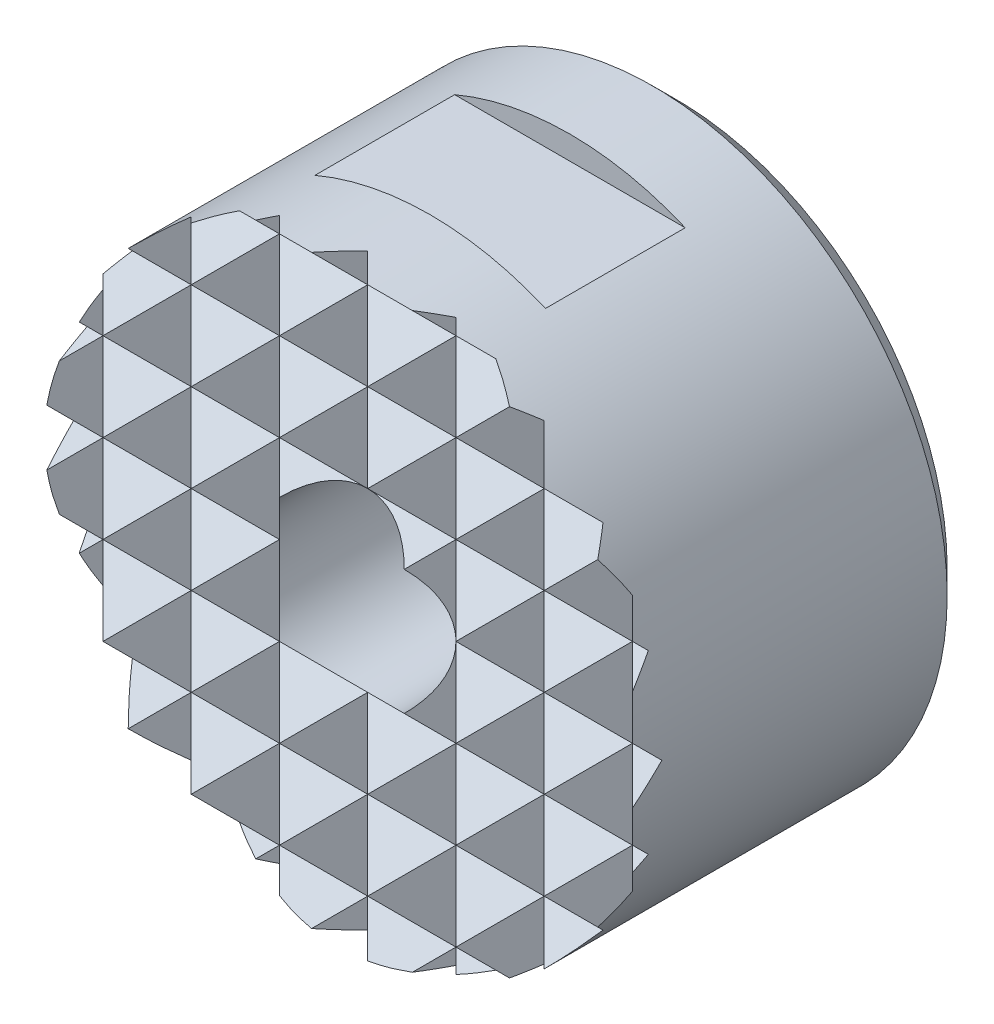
ISO-10303-21;
HEADER;
FILE_DESCRIPTION(('STEP AP214'),'2;1');
FILE_NAME('part.step','',(''),(''),'','','');
FILE_SCHEMA(('AUTOMOTIVE_DESIGN { 1 0 10303 214 1 1 1 1 }'));
ENDSEC;
DATA;
#1=APPLICATION_CONTEXT('core data for automotive mechanical design processes');
#2=APPLICATION_PROTOCOL_DEFINITION('international standard','automotive_design',2000,#1);
#3=PRODUCT_CONTEXT('',#1,'mechanical');
#4=PRODUCT('Part','Part','',(#3));
#5=PRODUCT_RELATED_PRODUCT_CATEGORY('part','',(#4));
#6=PRODUCT_DEFINITION_FORMATION('','',#4);
#7=PRODUCT_DEFINITION_CONTEXT('part definition',#1,'design');
#8=PRODUCT_DEFINITION('design','',#6,#7);
#9=PRODUCT_DEFINITION_SHAPE('','',#8);
#10=(LENGTH_UNIT() NAMED_UNIT(*) SI_UNIT(.MILLI.,.METRE.));
#11=(NAMED_UNIT(*) PLANE_ANGLE_UNIT() SI_UNIT($,.RADIAN.));
#12=(NAMED_UNIT(*) SI_UNIT($,.STERADIAN.) SOLID_ANGLE_UNIT());
#13=UNCERTAINTY_MEASURE_WITH_UNIT(LENGTH_MEASURE(1.E-05),#10,'distance_accuracy_value','');
#14=(GEOMETRIC_REPRESENTATION_CONTEXT(3) GLOBAL_UNCERTAINTY_ASSIGNED_CONTEXT((#13)) GLOBAL_UNIT_ASSIGNED_CONTEXT((#10,
#11,#12)) REPRESENTATION_CONTEXT('',''));
#15=CARTESIAN_POINT('',(0.,0.,0.));
#16=DIRECTION('',(0.,0.,1.));
#17=DIRECTION('',(1.,0.,0.));
#18=AXIS2_PLACEMENT_3D('',#15,#16,#17);
#19=CARTESIAN_POINT('',(4.5,-15.,12.));
#20=DIRECTION('',(-0.70710678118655,0.,-0.707106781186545));
#21=DIRECTION('',(-0.707106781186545,0.,0.70710678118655));
#22=AXIS2_PLACEMENT_3D('',#19,#20,#21);
#23=PLANE('',#22);
#24=DIRECTION('',(-0.577350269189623,-0.577350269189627,0.577350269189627));
#25=VECTOR('',#24,1.);
#26=CARTESIAN_POINT('',(2.,-10.,14.5));
#27=LINE('',#26,#25);
#28=CARTESIAN_POINT('',(6.,-6.,10.5));
#29=VERTEX_POINT('',#28);
#30=CARTESIAN_POINT('',(4.5,-7.5,12.));
#31=VERTEX_POINT('',#30);
#32=EDGE_CURVE('E724',#29,#31,#27,.T.);
#33=ORIENTED_EDGE('',*,*,#32,.T.);
#34=DIRECTION('',(0.577350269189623,-0.577350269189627,-0.577350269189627));
#35=VECTOR('',#34,1.);
#36=CARTESIAN_POINT('',(7.,-10.,9.5));
#37=LINE('',#36,#35);
#38=CARTESIAN_POINT('',(5.41013748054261,-8.41013748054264,11.0898625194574));
#39=VERTEX_POINT('',#38);
#40=EDGE_CURVE('E703',#31,#39,#37,.T.);
#41=ORIENTED_EDGE('',*,*,#40,.T.);
#42=CARTESIAN_POINT('',(0.,0.,16.5));
#43=DIRECTION('',(-0.70710678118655,0.,-0.707106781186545));
#44=DIRECTION('',(0.707106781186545,0.,-0.70710678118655));
#45=AXIS2_PLACEMENT_3D('',#42,#43,#44);
#46=ELLIPSE('',#45,14.142135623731,10.);
#47=CARTESIAN_POINT('',(6.,-8.,10.5));
#48=VERTEX_POINT('',#47);
#49=EDGE_CURVE('E606',#48,#39,#46,.T.);
#50=ORIENTED_EDGE('',*,*,#49,.F.);
#51=DIRECTION('',(0.,1.,0.));
#52=VECTOR('',#51,1.);
#53=CARTESIAN_POINT('',(6.,-15.,10.5));
#54=LINE('',#53,#52);
#55=EDGE_CURVE('E507',#48,#29,#54,.T.);
#56=ORIENTED_EDGE('',*,*,#55,.T.);
#57=EDGE_LOOP('',(#33,#41,#50,#56));
#58=FACE_BOUND('',#57,.T.);
#59=ADVANCED_FACE('F14',(#58),#23,.F.);
#60=CARTESIAN_POINT('',(5.41013748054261,8.41013748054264,11.0898625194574));
#61=VERTEX_POINT('',#60);
#62=CARTESIAN_POINT('',(6.,8.,10.5));
#63=VERTEX_POINT('',#62);
#64=EDGE_CURVE('E603',#61,#63,#46,.T.);
#65=ORIENTED_EDGE('',*,*,#64,.F.);
#66=DIRECTION('',(-0.577350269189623,-0.577350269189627,0.577350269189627));
#67=VECTOR('',#66,1.);
#68=CARTESIAN_POINT('',(-3.,0.,19.5));
#69=LINE('',#68,#67);
#70=CARTESIAN_POINT('',(4.5,7.5,12.));
#71=VERTEX_POINT('',#70);
#72=EDGE_CURVE('E1106',#61,#71,#69,.T.);
#73=ORIENTED_EDGE('',*,*,#72,.T.);
#74=DIRECTION('',(0.577350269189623,-0.577350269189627,-0.577350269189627));
#75=VECTOR('',#74,1.);
#76=CARTESIAN_POINT('',(12.,0.,4.49999999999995));
#77=LINE('',#76,#75);
#78=CARTESIAN_POINT('',(6.,6.,10.5));
#79=VERTEX_POINT('',#78);
#80=EDGE_CURVE('E1079',#71,#79,#77,.T.);
#81=ORIENTED_EDGE('',*,*,#80,.T.);
#82=EDGE_CURVE('E512',#79,#63,#54,.T.);
#83=ORIENTED_EDGE('',*,*,#82,.T.);
#84=EDGE_LOOP('',(#65,#73,#81,#83));
#85=FACE_BOUND('',#84,.T.);
#86=ADVANCED_FACE('F1455',(#85),#23,.F.);
#87=CARTESIAN_POINT('',(6.,-15.,10.5));
#88=DIRECTION('',(0.707106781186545,0.,-0.70710678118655));
#89=DIRECTION('',(-0.70710678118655,0.,-0.707106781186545));
#90=AXIS2_PLACEMENT_3D('',#87,#88,#89);
#91=PLANE('',#90);
#92=CARTESIAN_POINT('',(0.,0.,4.5));
#93=DIRECTION('',(0.707106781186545,0.,-0.70710678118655));
#94=DIRECTION('',(-0.70710678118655,0.,-0.707106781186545));
#95=AXIS2_PLACEMENT_3D('',#92,#93,#94);
#96=ELLIPSE('',#95,14.1421356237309,10.);
#97=CARTESIAN_POINT('',(7.07106781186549,-7.07106781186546,11.5710678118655));
#98=VERTEX_POINT('',#97);
#99=EDGE_CURVE('E610',#98,#48,#96,.T.);
#100=ORIENTED_EDGE('',*,*,#99,.F.);
#101=DIRECTION('',(-0.577350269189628,0.577350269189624,-0.577350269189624));
#102=VECTOR('',#101,1.);
#103=CARTESIAN_POINT('',(9.,-9.,13.5));
#104=LINE('',#103,#102);
#105=EDGE_CURVE('E726',#98,#29,#104,.T.);
#106=ORIENTED_EDGE('',*,*,#105,.T.);
#107=ORIENTED_EDGE('',*,*,#55,.F.);
#108=EDGE_LOOP('',(#100,#106,#107));
#109=FACE_BOUND('',#108,.T.);
#110=ADVANCED_FACE('F1400',(#109),#91,.F.);
#111=ORIENTED_EDGE('',*,*,#82,.F.);
#112=DIRECTION('',(0.577350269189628,0.577350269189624,0.577350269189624));
#113=VECTOR('',#112,1.);
#114=CARTESIAN_POINT('',(-1.00000000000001,-0.99999999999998,3.5));
#115=LINE('',#114,#113);
#116=CARTESIAN_POINT('',(7.07106781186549,7.07106781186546,11.5710678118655));
#117=VERTEX_POINT('',#116);
#118=EDGE_CURVE('E1082',#79,#117,#115,.T.);
#119=ORIENTED_EDGE('',*,*,#118,.T.);
#120=EDGE_CURVE('E605',#63,#117,#96,.T.);
#121=ORIENTED_EDGE('',*,*,#120,.F.);
#122=EDGE_LOOP('',(#111,#119,#121));
#123=FACE_BOUND('',#122,.T.);
#124=ADVANCED_FACE('F1452',(#123),#91,.F.);
#125=CARTESIAN_POINT('',(7.5,-15.,12.));
#126=DIRECTION('',(-0.70710678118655,0.,-0.707106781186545));
#127=DIRECTION('',(-0.707106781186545,0.,0.70710678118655));
#128=AXIS2_PLACEMENT_3D('',#125,#126,#127);
#129=PLANE('',#128);
#130=DIRECTION('',(-0.577350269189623,-0.577350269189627,0.577350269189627));
#131=VECTOR('',#130,1.);
#132=CARTESIAN_POINT('',(4.,-8.,15.5));
#133=LINE('',#132,#131);
#134=CARTESIAN_POINT('',(9.,-3.,10.5));
#135=VERTEX_POINT('',#134);
#136=CARTESIAN_POINT('',(7.5,-4.5,12.));
#137=VERTEX_POINT('',#136);
#138=EDGE_CURVE('E802',#135,#137,#133,.T.);
#139=ORIENTED_EDGE('',*,*,#138,.T.);
#140=DIRECTION('',(0.577350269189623,-0.577350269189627,-0.577350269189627));
#141=VECTOR('',#140,1.);
#142=CARTESIAN_POINT('',(11.,-8.,8.5));
#143=LINE('',#142,#141);
#144=CARTESIAN_POINT('',(8.41013748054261,-5.41013748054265,11.0898625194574));
#145=VERTEX_POINT('',#144);
#146=EDGE_CURVE('E763',#137,#145,#143,.T.);
#147=ORIENTED_EDGE('',*,*,#146,.T.);
#148=CARTESIAN_POINT('',(0.,0.,19.5));
#149=DIRECTION('',(-0.70710678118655,0.,-0.707106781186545));
#150=DIRECTION('',(0.707106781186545,0.,-0.70710678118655));
#151=AXIS2_PLACEMENT_3D('',#148,#149,#150);
#152=ELLIPSE('',#151,14.142135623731,10.);
#153=CARTESIAN_POINT('',(9.,-4.35889894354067,10.5));
#154=VERTEX_POINT('',#153);
#155=EDGE_CURVE('E613',#154,#145,#152,.T.);
#156=ORIENTED_EDGE('',*,*,#155,.F.);
#157=DIRECTION('',(0.,1.,0.));
#158=VECTOR('',#157,1.);
#159=CARTESIAN_POINT('',(9.,-15.,10.5));
#160=LINE('',#159,#158);
#161=EDGE_CURVE('E513',#154,#135,#160,.T.);
#162=ORIENTED_EDGE('',*,*,#161,.T.);
#163=EDGE_LOOP('',(#139,#147,#156,#162));
#164=FACE_BOUND('',#163,.T.);
#165=ADVANCED_FACE('F1414',(#164),#129,.F.);
#166=DIRECTION('',(-0.577350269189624,-0.577350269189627,0.577350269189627));
#167=VECTOR('',#166,1.);
#168=CARTESIAN_POINT('',(3.,-6.,16.5));
#169=LINE('',#168,#167);
#170=CARTESIAN_POINT('',(9.,0.,10.5));
#171=VERTEX_POINT('',#170);
#172=CARTESIAN_POINT('',(7.5,-1.50000000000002,12.));
#173=VERTEX_POINT('',#172);
#174=EDGE_CURVE('E872',#171,#173,#169,.T.);
#175=ORIENTED_EDGE('',*,*,#174,.T.);
#176=DIRECTION('',(0.577350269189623,-0.577350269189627,-0.577350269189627));
#177=VECTOR('',#176,1.);
#178=CARTESIAN_POINT('',(12.,-6.,7.5));
#179=LINE('',#178,#177);
#180=EDGE_CURVE('E841',#173,#135,#179,.T.);
#181=ORIENTED_EDGE('',*,*,#180,.T.);
#182=EDGE_CURVE('E516',#135,#171,#160,.T.);
#183=ORIENTED_EDGE('',*,*,#182,.T.);
#184=EDGE_LOOP('',(#175,#181,#183));
#185=FACE_BOUND('',#184,.T.);
#186=ADVANCED_FACE('F1422',(#185),#129,.F.);
#187=DIRECTION('',(-0.577350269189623,-0.577350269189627,0.577350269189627));
#188=VECTOR('',#187,1.);
#189=CARTESIAN_POINT('',(2.,-4.,17.5));
#190=LINE('',#189,#188);
#191=CARTESIAN_POINT('',(9.,3.,10.5));
#192=VERTEX_POINT('',#191);
#193=CARTESIAN_POINT('',(7.5,1.49999999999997,12.));
#194=VERTEX_POINT('',#193);
#195=EDGE_CURVE('E485',#192,#194,#190,.T.);
#196=ORIENTED_EDGE('',*,*,#195,.T.);
#197=DIRECTION('',(0.577350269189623,-0.577350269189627,-0.577350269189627));
#198=VECTOR('',#197,1.);
#199=CARTESIAN_POINT('',(13.,-4.00000000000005,6.5));
#200=LINE('',#199,#198);
#201=EDGE_CURVE('E901',#194,#171,#200,.T.);
#202=ORIENTED_EDGE('',*,*,#201,.T.);
#203=EDGE_CURVE('E1430',#171,#192,#160,.T.);
#204=ORIENTED_EDGE('',*,*,#203,.T.);
#205=EDGE_LOOP('',(#196,#202,#204));
#206=FACE_BOUND('',#205,.T.);
#207=ADVANCED_FACE('F1679',(#206),#129,.F.);
#208=CARTESIAN_POINT('',(9.,-15.,10.5));
#209=DIRECTION('',(0.707106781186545,0.,-0.70710678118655));
#210=DIRECTION('',(-0.70710678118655,0.,-0.707106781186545));
#211=AXIS2_PLACEMENT_3D('',#208,#209,#210);
#212=PLANE('',#211);
#213=ORIENTED_EDGE('',*,*,#203,.F.);
#214=DIRECTION('',(0.577350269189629,0.577350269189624,0.577350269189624));
#215=VECTOR('',#214,1.);
#216=CARTESIAN_POINT('',(4.,-5.,5.5));
#217=LINE('',#216,#215);
#218=CARTESIAN_POINT('',(9.95435605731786,0.954356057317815,11.4543560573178));
#219=VERTEX_POINT('',#218);
#220=EDGE_CURVE('E904',#171,#219,#217,.T.);
#221=ORIENTED_EDGE('',*,*,#220,.T.);
#222=CARTESIAN_POINT('',(0.,0.,1.50000000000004));
#223=DIRECTION('',(0.707106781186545,0.,-0.70710678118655));
#224=DIRECTION('',(-0.70710678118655,0.,-0.707106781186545));
#225=AXIS2_PLACEMENT_3D('',#222,#223,#224);
#226=ELLIPSE('',#225,14.1421356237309,10.);
#227=CARTESIAN_POINT('',(9.74165738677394,2.2583426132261,11.2416573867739));
#228=VERTEX_POINT('',#227);
#229=EDGE_CURVE('E617',#228,#219,#226,.T.);
#230=ORIENTED_EDGE('',*,*,#229,.F.);
#231=DIRECTION('',(-0.577350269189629,0.577350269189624,-0.577350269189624));
#232=VECTOR('',#231,1.);
#233=CARTESIAN_POINT('',(15.,-2.99999999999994,16.5));
#234=LINE('',#233,#232);
#235=EDGE_CURVE('E477',#228,#192,#234,.T.);
#236=ORIENTED_EDGE('',*,*,#235,.T.);
#237=EDGE_LOOP('',(#213,#221,#230,#236));
#238=FACE_BOUND('',#237,.T.);
#239=ADVANCED_FACE('F1671',(#238),#212,.F.);
#240=CARTESIAN_POINT('',(9.95435605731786,-0.954356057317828,11.4543560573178));
#241=VERTEX_POINT('',#240);
#242=CARTESIAN_POINT('',(9.74165738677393,-2.25834261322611,11.2416573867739));
#243=VERTEX_POINT('',#242);
#244=EDGE_CURVE('E3028',#241,#243,#226,.T.);
#245=ORIENTED_EDGE('',*,*,#244,.F.);
#246=DIRECTION('',(-0.577350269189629,0.577350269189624,-0.577350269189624));
#247=VECTOR('',#246,1.);
#248=CARTESIAN_POINT('',(14.,-5.,15.5));
#249=LINE('',#248,#247);
#250=EDGE_CURVE('E874',#241,#171,#249,.T.);
#251=ORIENTED_EDGE('',*,*,#250,.T.);
#252=ORIENTED_EDGE('',*,*,#182,.F.);
#253=DIRECTION('',(0.577350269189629,0.577350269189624,0.577350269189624));
#254=VECTOR('',#253,1.);
#255=CARTESIAN_POINT('',(5.,-7.,6.5));
#256=LINE('',#255,#254);
#257=EDGE_CURVE('E844',#135,#243,#256,.T.);
#258=ORIENTED_EDGE('',*,*,#257,.T.);
#259=EDGE_LOOP('',(#245,#251,#252,#258));
#260=FACE_BOUND('',#259,.T.);
#261=ADVANCED_FACE('F1428',(#260),#212,.F.);
#262=CARTESIAN_POINT('',(9.40312423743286,-3.40312423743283,10.9031242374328));
#263=VERTEX_POINT('',#262);
#264=EDGE_CURVE('E612',#263,#154,#226,.T.);
#265=ORIENTED_EDGE('',*,*,#264,.F.);
#266=DIRECTION('',(-0.577350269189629,0.577350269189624,-0.577350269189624));
#267=VECTOR('',#266,1.);
#268=CARTESIAN_POINT('',(13.,-7.,14.5));
#269=LINE('',#268,#267);
#270=EDGE_CURVE('E804',#263,#135,#269,.T.);
#271=ORIENTED_EDGE('',*,*,#270,.T.);
#272=ORIENTED_EDGE('',*,*,#161,.F.);
#273=EDGE_LOOP('',(#265,#271,#272));
#274=FACE_BOUND('',#273,.T.);
#275=ADVANCED_FACE('F1417',(#274),#212,.F.);
#276=CARTESIAN_POINT('',(-10.5,-15.,12.));
#277=DIRECTION('',(-0.70710678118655,0.,-0.707106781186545));
#278=DIRECTION('',(-0.707106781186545,0.,0.70710678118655));
#279=AXIS2_PLACEMENT_3D('',#276,#277,#278);
#280=PLANE('',#279);
#281=CARTESIAN_POINT('',(0.,0.,1.5));
#282=DIRECTION('',(-0.70710678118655,0.,-0.707106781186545));
#283=DIRECTION('',(0.707106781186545,0.,-0.70710678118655));
#284=AXIS2_PLACEMENT_3D('',#281,#282,#283);
#285=ELLIPSE('',#284,14.142135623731,10.);
#286=CARTESIAN_POINT('',(-9.95435605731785,0.954356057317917,11.4543560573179));
#287=VERTEX_POINT('',#286);
#288=CARTESIAN_POINT('',(-9.74165738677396,2.25834261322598,11.241657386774));
#289=VERTEX_POINT('',#288);
#290=EDGE_CURVE('E466',#287,#289,#285,.T.);
#291=ORIENTED_EDGE('',*,*,#290,.F.);
#292=DIRECTION('',(0.577350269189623,-0.577350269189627,-0.577350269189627));
#293=VECTOR('',#292,1.);
#294=CARTESIAN_POINT('',(-5.,-4.,6.5));
#295=LINE('',#294,#293);
#296=CARTESIAN_POINT('',(-9.,0.,10.5));
#297=VERTEX_POINT('',#296);
#298=EDGE_CURVE('E886',#287,#297,#295,.T.);
#299=ORIENTED_EDGE('',*,*,#298,.T.);
#300=DIRECTION('',(0.,1.,0.));
#301=VECTOR('',#300,1.);
#302=CARTESIAN_POINT('',(-9.,-15.,10.5));
#303=LINE('',#302,#301);
#304=CARTESIAN_POINT('',(-9.,3.,10.5));
#305=VERTEX_POINT('',#304);
#306=EDGE_CURVE('E923',#297,#305,#303,.T.);
#307=ORIENTED_EDGE('',*,*,#306,.T.);
#308=DIRECTION('',(-0.577350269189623,-0.577350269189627,0.577350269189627));
#309=VECTOR('',#308,1.);
#310=CARTESIAN_POINT('',(-16.,-4.,17.5));
#311=LINE('',#310,#309);
#312=EDGE_CURVE('E455',#305,#289,#311,.T.);
#313=ORIENTED_EDGE('',*,*,#312,.T.);
#314=EDGE_LOOP('',(#291,#299,#307,#313));
#315=FACE_BOUND('',#314,.T.);
#316=ADVANCED_FACE('F921',(#315),#280,.F.);
#317=CARTESIAN_POINT('',(-9.,-3.,10.5));
#318=VERTEX_POINT('',#317);
#319=EDGE_CURVE('E521',#318,#297,#303,.T.);
#320=ORIENTED_EDGE('',*,*,#319,.T.);
#321=DIRECTION('',(-0.577350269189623,-0.577350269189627,0.577350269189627));
#322=VECTOR('',#321,1.);
#323=CARTESIAN_POINT('',(-15.,-6.,16.5));
#324=LINE('',#323,#322);
#325=CARTESIAN_POINT('',(-9.95435605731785,-0.954356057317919,11.4543560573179));
#326=VERTEX_POINT('',#325);
#327=EDGE_CURVE('E856',#297,#326,#324,.T.);
#328=ORIENTED_EDGE('',*,*,#327,.T.);
#329=CARTESIAN_POINT('',(-9.74165738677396,-2.25834261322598,11.241657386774));
#330=VERTEX_POINT('',#329);
#331=EDGE_CURVE('E602',#330,#326,#285,.T.);
#332=ORIENTED_EDGE('',*,*,#331,.F.);
#333=DIRECTION('',(0.577350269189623,-0.577350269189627,-0.577350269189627));
#334=VECTOR('',#333,1.);
#335=CARTESIAN_POINT('',(-6.,-6.,7.5));
#336=LINE('',#335,#334);
#337=EDGE_CURVE('E819',#330,#318,#336,.T.);
#338=ORIENTED_EDGE('',*,*,#337,.T.);
#339=EDGE_LOOP('',(#320,#328,#332,#338));
#340=FACE_BOUND('',#339,.T.);
#341=ADVANCED_FACE('F943',(#340),#280,.F.);
#342=CARTESIAN_POINT('',(-9.,-4.35889894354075,10.5));
#343=VERTEX_POINT('',#342);
#344=EDGE_CURVE('E518',#343,#318,#303,.T.);
#345=ORIENTED_EDGE('',*,*,#344,.T.);
#346=DIRECTION('',(-0.577350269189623,-0.577350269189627,0.577350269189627));
#347=VECTOR('',#346,1.);
#348=CARTESIAN_POINT('',(-14.,-8.,15.5));
#349=LINE('',#348,#347);
#350=CARTESIAN_POINT('',(-9.40312423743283,-3.4031242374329,10.9031242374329));
#351=VERTEX_POINT('',#350);
#352=EDGE_CURVE('E778',#318,#351,#349,.T.);
#353=ORIENTED_EDGE('',*,*,#352,.T.);
#354=EDGE_CURVE('E599',#343,#351,#285,.T.);
#355=ORIENTED_EDGE('',*,*,#354,.F.);
#356=EDGE_LOOP('',(#345,#353,#355));
#357=FACE_BOUND('',#356,.T.);
#358=ADVANCED_FACE('F1663',(#357),#280,.F.);
#359=CARTESIAN_POINT('',(-9.,-15.,10.5));
#360=DIRECTION('',(0.707106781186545,0.,-0.707106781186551));
#361=DIRECTION('',(-0.707106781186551,0.,-0.707106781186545));
#362=AXIS2_PLACEMENT_3D('',#359,#360,#361);
#363=PLANE('',#362);
#364=CARTESIAN_POINT('',(0.,0.,19.5));
#365=DIRECTION('',(0.707106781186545,0.,-0.707106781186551));
#366=DIRECTION('',(-0.707106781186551,0.,-0.707106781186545));
#367=AXIS2_PLACEMENT_3D('',#364,#365,#366);
#368=ELLIPSE('',#367,14.1421356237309,10.);
#369=CARTESIAN_POINT('',(-8.41013748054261,-5.41013748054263,11.0898625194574));
#370=VERTEX_POINT('',#369);
#371=EDGE_CURVE('E598',#370,#343,#368,.T.);
#372=ORIENTED_EDGE('',*,*,#371,.F.);
#373=DIRECTION('',(0.577350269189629,0.577350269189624,0.577350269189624));
#374=VECTOR('',#373,1.);
#375=CARTESIAN_POINT('',(-12.,-9.,7.5));
#376=LINE('',#375,#374);
#377=CARTESIAN_POINT('',(-7.5,-4.5,12.));
#378=VERTEX_POINT('',#377);
#379=EDGE_CURVE('E738',#370,#378,#376,.T.);
#380=ORIENTED_EDGE('',*,*,#379,.T.);
#381=DIRECTION('',(-0.577350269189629,0.577350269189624,-0.577350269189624));
#382=VECTOR('',#381,1.);
#383=CARTESIAN_POINT('',(-5.,-7.,14.5));
#384=LINE('',#383,#382);
#385=EDGE_CURVE('E775',#378,#318,#384,.T.);
#386=ORIENTED_EDGE('',*,*,#385,.T.);
#387=ORIENTED_EDGE('',*,*,#344,.F.);
#388=EDGE_LOOP('',(#372,#380,#386,#387));
#389=FACE_BOUND('',#388,.T.);
#390=ADVANCED_FACE('F1654',(#389),#363,.F.);
#391=ORIENTED_EDGE('',*,*,#319,.F.);
#392=DIRECTION('',(0.577350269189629,0.577350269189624,0.577350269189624));
#393=VECTOR('',#392,1.);
#394=CARTESIAN_POINT('',(-13.,-7.,6.5));
#395=LINE('',#394,#393);
#396=CARTESIAN_POINT('',(-7.5,-1.5,12.));
#397=VERTEX_POINT('',#396);
#398=EDGE_CURVE('E816',#318,#397,#395,.T.);
#399=ORIENTED_EDGE('',*,*,#398,.T.);
#400=DIRECTION('',(-0.577350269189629,0.577350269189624,-0.577350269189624));
#401=VECTOR('',#400,1.);
#402=CARTESIAN_POINT('',(-4.,-5.,15.5));
#403=LINE('',#402,#401);
#404=EDGE_CURVE('E853',#397,#297,#403,.T.);
#405=ORIENTED_EDGE('',*,*,#404,.T.);
#406=EDGE_LOOP('',(#391,#399,#405));
#407=FACE_BOUND('',#406,.T.);
#408=ADVANCED_FACE('F1855',(#407),#363,.F.);
#409=ORIENTED_EDGE('',*,*,#306,.F.);
#410=DIRECTION('',(0.577350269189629,0.577350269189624,0.577350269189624));
#411=VECTOR('',#410,1.);
#412=CARTESIAN_POINT('',(-14.,-5.,5.5));
#413=LINE('',#412,#411);
#414=CARTESIAN_POINT('',(-7.5,1.5,12.));
#415=VERTEX_POINT('',#414);
#416=EDGE_CURVE('E883',#297,#415,#413,.T.);
#417=ORIENTED_EDGE('',*,*,#416,.T.);
#418=DIRECTION('',(-0.577350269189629,0.577350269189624,-0.577350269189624));
#419=VECTOR('',#418,1.);
#420=CARTESIAN_POINT('',(-2.99999999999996,-3.,16.5));
#421=LINE('',#420,#419);
#422=EDGE_CURVE('E916',#415,#305,#421,.T.);
#423=ORIENTED_EDGE('',*,*,#422,.T.);
#424=EDGE_LOOP('',(#409,#417,#423));
#425=FACE_BOUND('',#424,.T.);
#426=ADVANCED_FACE('F1655',(#425),#363,.F.);
#427=CARTESIAN_POINT('',(-7.5,-15.,12.));
#428=DIRECTION('',(-0.70710678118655,0.,-0.707106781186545));
#429=DIRECTION('',(-0.707106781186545,0.,0.70710678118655));
#430=AXIS2_PLACEMENT_3D('',#427,#428,#429);
#431=PLANE('',#430);
#432=DIRECTION('',(0.,1.,0.));
#433=VECTOR('',#432,1.);
#434=CARTESIAN_POINT('',(-6.,-15.,10.5));
#435=LINE('',#434,#433);
#436=CARTESIAN_POINT('',(-6.,-8.,10.5));
#437=VERTEX_POINT('',#436);
#438=CARTESIAN_POINT('',(-6.,-6.,10.5));
#439=VERTEX_POINT('',#438);
#440=EDGE_CURVE('E523',#437,#439,#435,.T.);
#441=ORIENTED_EDGE('',*,*,#440,.T.);
#442=DIRECTION('',(-0.577350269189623,-0.577350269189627,0.577350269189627));
#443=VECTOR('',#442,1.);
#444=CARTESIAN_POINT('',(-10.,-10.,14.5));
#445=LINE('',#444,#443);
#446=CARTESIAN_POINT('',(-7.07106781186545,-7.07106781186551,11.5710678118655));
#447=VERTEX_POINT('',#446);
#448=EDGE_CURVE('E676',#439,#447,#445,.T.);
#449=ORIENTED_EDGE('',*,*,#448,.T.);
#450=CARTESIAN_POINT('',(0.,0.,4.5));
#451=DIRECTION('',(-0.70710678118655,0.,-0.707106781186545));
#452=DIRECTION('',(0.707106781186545,0.,-0.70710678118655));
#453=AXIS2_PLACEMENT_3D('',#450,#451,#452);
#454=ELLIPSE('',#453,14.142135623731,10.);
#455=EDGE_CURVE('E594',#437,#447,#454,.T.);
#456=ORIENTED_EDGE('',*,*,#455,.F.);
#457=EDGE_LOOP('',(#441,#449,#456));
#458=FACE_BOUND('',#457,.T.);
#459=ADVANCED_FACE('F1835',(#458),#431,.F.);
#460=CARTESIAN_POINT('',(-7.07106781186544,7.07106781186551,11.5710678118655));
#461=VERTEX_POINT('',#460);
#462=CARTESIAN_POINT('',(-6.,8.,10.5));
#463=VERTEX_POINT('',#462);
#464=EDGE_CURVE('E590',#461,#463,#454,.T.);
#465=ORIENTED_EDGE('',*,*,#464,.F.);
#466=DIRECTION('',(0.577350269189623,-0.577350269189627,-0.577350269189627));
#467=VECTOR('',#466,1.);
#468=CARTESIAN_POINT('',(0.,0.,4.5));
#469=LINE('',#468,#467);
#470=CARTESIAN_POINT('',(-6.,6.,10.5));
#471=VERTEX_POINT('',#470);
#472=EDGE_CURVE('E1061',#461,#471,#469,.T.);
#473=ORIENTED_EDGE('',*,*,#472,.T.);
#474=EDGE_CURVE('E526',#471,#463,#435,.T.);
#475=ORIENTED_EDGE('',*,*,#474,.T.);
#476=EDGE_LOOP('',(#465,#473,#475));
#477=FACE_BOUND('',#476,.T.);
#478=ADVANCED_FACE('F1826',(#477),#431,.F.);
#479=CARTESIAN_POINT('',(-6.,-15.,10.5));
#480=DIRECTION('',(0.707106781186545,0.,-0.70710678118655));
#481=DIRECTION('',(-0.70710678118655,0.,-0.707106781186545));
#482=AXIS2_PLACEMENT_3D('',#479,#480,#481);
#483=PLANE('',#482);
#484=CARTESIAN_POINT('',(0.,0.,16.5));
#485=DIRECTION('',(0.707106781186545,0.,-0.70710678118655));
#486=DIRECTION('',(-0.70710678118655,0.,-0.707106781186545));
#487=AXIS2_PLACEMENT_3D('',#484,#485,#486);
#488=ELLIPSE('',#487,14.1421356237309,10.);
#489=CARTESIAN_POINT('',(-5.41013748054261,-8.41013748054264,11.0898625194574));
#490=VERTEX_POINT('',#489);
#491=EDGE_CURVE('E591',#490,#437,#488,.T.);
#492=ORIENTED_EDGE('',*,*,#491,.F.);
#493=DIRECTION('',(0.577350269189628,0.577350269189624,0.577350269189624));
#494=VECTOR('',#493,1.);
#495=CARTESIAN_POINT('',(-8.,-11.,8.5));
#496=LINE('',#495,#494);
#497=CARTESIAN_POINT('',(-4.49999999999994,-7.5,12.));
#498=VERTEX_POINT('',#497);
#499=EDGE_CURVE('E661',#490,#498,#496,.T.);
#500=ORIENTED_EDGE('',*,*,#499,.T.);
#501=DIRECTION('',(-0.577350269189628,0.577350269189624,-0.577350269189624));
#502=VECTOR('',#501,1.);
#503=CARTESIAN_POINT('',(-2.99999999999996,-9.,13.5));
#504=LINE('',#503,#502);
#505=EDGE_CURVE('E668',#498,#439,#504,.T.);
#506=ORIENTED_EDGE('',*,*,#505,.T.);
#507=ORIENTED_EDGE('',*,*,#440,.F.);
#508=EDGE_LOOP('',(#492,#500,#506,#507));
#509=FACE_BOUND('',#508,.T.);
#510=ADVANCED_FACE('F680',(#509),#483,.F.);
#511=DIRECTION('',(0.577350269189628,0.577350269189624,0.577350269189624));
#512=VECTOR('',#511,1.);
#513=CARTESIAN_POINT('',(-13.,-0.999999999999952,3.5));
#514=LINE('',#513,#512);
#515=CARTESIAN_POINT('',(-4.49999999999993,7.5,12.));
#516=VERTEX_POINT('',#515);
#517=EDGE_CURVE('E1058',#471,#516,#514,.T.);
#518=ORIENTED_EDGE('',*,*,#517,.T.);
#519=DIRECTION('',(-0.577350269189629,0.577350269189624,-0.577350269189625));
#520=VECTOR('',#519,1.);
#521=CARTESIAN_POINT('',(2.00000000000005,1.00000000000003,18.5));
#522=LINE('',#521,#520);
#523=CARTESIAN_POINT('',(-5.41013748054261,8.41013748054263,11.0898625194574));
#524=VERTEX_POINT('',#523);
#525=EDGE_CURVE('E1088',#516,#524,#522,.T.);
#526=ORIENTED_EDGE('',*,*,#525,.T.);
#527=EDGE_CURVE('E587',#463,#524,#488,.T.);
#528=ORIENTED_EDGE('',*,*,#527,.F.);
#529=ORIENTED_EDGE('',*,*,#474,.F.);
#530=EDGE_LOOP('',(#518,#526,#528,#529));
#531=FACE_BOUND('',#530,.T.);
#532=ADVANCED_FACE('F1809',(#531),#483,.F.);
#533=CARTESIAN_POINT('',(-2.99999999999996,-15.,10.5));
#534=DIRECTION('',(0.707106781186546,0.,-0.707106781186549));
#535=DIRECTION('',(-0.707106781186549,0.,-0.707106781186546));
#536=AXIS2_PLACEMENT_3D('',#533,#534,#535);
#537=PLANE('',#536);
#538=DIRECTION('',(0.,1.,0.));
#539=VECTOR('',#538,1.);
#540=CARTESIAN_POINT('',(-2.99999999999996,-15.,10.5));
#541=LINE('',#540,#539);
#542=CARTESIAN_POINT('',(-2.99999999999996,9.,10.5));
#543=VERTEX_POINT('',#542);
#544=CARTESIAN_POINT('',(-2.99999999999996,9.53939201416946,10.5));
#545=VERTEX_POINT('',#544);
#546=EDGE_CURVE('E476',#543,#545,#541,.T.);
#547=ORIENTED_EDGE('',*,*,#546,.F.);
#548=DIRECTION('',(0.577350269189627,0.577350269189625,0.577350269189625));
#549=VECTOR('',#548,1.);
#550=CARTESIAN_POINT('',(-11.,1.00000000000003,2.5));
#551=LINE('',#550,#549);
#552=CARTESIAN_POINT('',(-2.25834261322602,9.74165738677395,11.2416573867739));
#553=VERTEX_POINT('',#552);
#554=EDGE_CURVE('E1108',#543,#553,#551,.T.);
#555=ORIENTED_EDGE('',*,*,#554,.T.);
#556=CARTESIAN_POINT('',(0.,0.,13.5));
#557=DIRECTION('',(0.707106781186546,0.,-0.707106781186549));
#558=DIRECTION('',(-0.707106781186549,0.,-0.707106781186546));
#559=AXIS2_PLACEMENT_3D('',#556,#557,#558);
#560=ELLIPSE('',#559,14.1421356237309,10.);
#561=EDGE_CURVE('E549',#545,#553,#560,.T.);
#562=ORIENTED_EDGE('',*,*,#561,.F.);
#563=EDGE_LOOP('',(#547,#555,#562));
#564=FACE_BOUND('',#563,.T.);
#565=ADVANCED_FACE('F1208',(#564),#537,.F.);
#566=CARTESIAN_POINT('',(0.,0.,13.5));
#567=DIRECTION('',(0.707106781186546,0.,-0.707106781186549));
#568=DIRECTION('',(0.707106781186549,0.,0.707106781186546));
#569=AXIS2_PLACEMENT_3D('',#566,#567,#568);
#570=ELLIPSE('',#569,4.24264068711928,3.);
#571=CARTESIAN_POINT('',(-2.99999999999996,0.,10.5));
#572=VERTEX_POINT('',#571);
#573=CARTESIAN_POINT('',(-2.12132034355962,2.12132034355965,11.3786796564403));
#574=VERTEX_POINT('',#573);
#575=EDGE_CURVE('E583',#572,#574,#570,.T.);
#576=ORIENTED_EDGE('',*,*,#575,.T.);
#577=DIRECTION('',(-0.577350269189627,0.577350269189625,-0.577350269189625));
#578=VECTOR('',#577,1.);
#579=CARTESIAN_POINT('',(3.00000000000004,-3.,16.5));
#580=LINE('',#579,#578);
#581=CARTESIAN_POINT('',(-2.99999999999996,3.,10.5));
#582=VERTEX_POINT('',#581);
#583=EDGE_CURVE('E907',#574,#582,#580,.T.);
#584=ORIENTED_EDGE('',*,*,#583,.T.);
#585=EDGE_CURVE('E483',#572,#582,#541,.T.);
#586=ORIENTED_EDGE('',*,*,#585,.F.);
#587=EDGE_LOOP('',(#576,#584,#586));
#588=FACE_BOUND('',#587,.T.);
#589=ADVANCED_FACE('F1793',(#588),#537,.F.);
#590=CARTESIAN_POINT('',(-2.99999999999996,-3.,10.5));
#591=VERTEX_POINT('',#590);
#592=EDGE_CURVE('E529',#591,#572,#541,.T.);
#593=ORIENTED_EDGE('',*,*,#592,.F.);
#594=DIRECTION('',(0.577350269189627,0.577350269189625,0.577350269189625));
#595=VECTOR('',#594,1.);
#596=CARTESIAN_POINT('',(-7.,-7.,6.5));
#597=LINE('',#596,#595);
#598=CARTESIAN_POINT('',(-2.12132034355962,-2.12132034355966,11.3786796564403));
#599=VERTEX_POINT('',#598);
#600=EDGE_CURVE('E807',#591,#599,#597,.T.);
#601=ORIENTED_EDGE('',*,*,#600,.T.);
#602=EDGE_CURVE('E586',#599,#572,#570,.T.);
#603=ORIENTED_EDGE('',*,*,#602,.T.);
#604=EDGE_LOOP('',(#593,#601,#603));
#605=FACE_BOUND('',#604,.T.);
#606=ADVANCED_FACE('F1784',(#605),#537,.F.);
#607=CARTESIAN_POINT('',(-1.49999999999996,-15.,12.));
#608=DIRECTION('',(-0.707106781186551,0.,-0.707106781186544));
#609=DIRECTION('',(-0.707106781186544,0.,0.707106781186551));
#610=AXIS2_PLACEMENT_3D('',#607,#608,#609);
#611=PLANE('',#610);
#612=CARTESIAN_POINT('',(0.,0.,10.5));
#613=DIRECTION('',(-0.707106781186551,0.,-0.707106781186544));
#614=DIRECTION('',(0.707106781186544,0.,-0.707106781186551));
#615=AXIS2_PLACEMENT_3D('',#612,#613,#614);
#616=ELLIPSE('',#615,14.142135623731,10.);
#617=CARTESIAN_POINT('',(-0.954356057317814,9.95435605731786,11.4543560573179));
#618=VERTEX_POINT('',#617);
#619=CARTESIAN_POINT('',(0.,10.,10.5));
#620=VERTEX_POINT('',#619);
#621=EDGE_CURVE('E544',#618,#620,#616,.T.);
#622=ORIENTED_EDGE('',*,*,#621,.F.);
#623=DIRECTION('',(0.577350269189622,-0.577350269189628,-0.577350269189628));
#624=VECTOR('',#623,1.);
#625=CARTESIAN_POINT('',(7.,1.99999999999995,3.49999999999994));
#626=LINE('',#625,#624);
#627=CARTESIAN_POINT('',(0.,9.,10.5));
#628=VERTEX_POINT('',#627);
#629=EDGE_CURVE('E1116',#618,#628,#626,.T.);
#630=ORIENTED_EDGE('',*,*,#629,.T.);
#631=DIRECTION('',(0.,1.,0.));
#632=VECTOR('',#631,1.);
#633=CARTESIAN_POINT('',(0.,-15.,10.5));
#634=LINE('',#633,#632);
#635=EDGE_CURVE('E499',#628,#620,#634,.T.);
#636=ORIENTED_EDGE('',*,*,#635,.T.);
#637=EDGE_LOOP('',(#622,#630,#636));
#638=FACE_BOUND('',#637,.T.);
#639=ADVANCED_FACE('F1776',(#638),#611,.F.);
#640=CARTESIAN_POINT('',(0.,-15.,10.5));
#641=DIRECTION('',(0.707106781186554,0.,-0.707106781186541));
#642=DIRECTION('',(-0.707106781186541,0.,-0.707106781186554));
#643=AXIS2_PLACEMENT_3D('',#640,#641,#642);
#644=PLANE('',#643);
#645=ORIENTED_EDGE('',*,*,#635,.F.);
#646=DIRECTION('',(0.577350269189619,0.577350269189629,0.577350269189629));
#647=VECTOR('',#646,1.);
#648=CARTESIAN_POINT('',(-8.,0.999999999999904,2.4999999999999));
#649=LINE('',#648,#647);
#650=CARTESIAN_POINT('',(0.954356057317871,9.95435605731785,11.4543560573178));
#651=VERTEX_POINT('',#650);
#652=EDGE_CURVE('E1119',#628,#651,#649,.T.);
#653=ORIENTED_EDGE('',*,*,#652,.T.);
#654=CARTESIAN_POINT('',(0.,0.,10.5));
#655=DIRECTION('',(0.707106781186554,0.,-0.707106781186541));
#656=DIRECTION('',(-0.707106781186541,0.,-0.707106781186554));
#657=AXIS2_PLACEMENT_3D('',#654,#655,#656);
#658=ELLIPSE('',#657,14.1421356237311,10.);
#659=EDGE_CURVE('E543',#620,#651,#658,.T.);
#660=ORIENTED_EDGE('',*,*,#659,.F.);
#661=EDGE_LOOP('',(#645,#653,#660));
#662=FACE_BOUND('',#661,.T.);
#663=ADVANCED_FACE('F1623',(#662),#644,.F.);
#664=CARTESIAN_POINT('',(1.5,-15.,12.));
#665=DIRECTION('',(-0.70710678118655,0.,-0.707106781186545));
#666=DIRECTION('',(-0.707106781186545,0.,0.70710678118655));
#667=AXIS2_PLACEMENT_3D('',#664,#665,#666);
#668=PLANE('',#667);
#669=CARTESIAN_POINT('',(0.,0.,13.5));
#670=DIRECTION('',(-0.70710678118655,0.,-0.707106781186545));
#671=DIRECTION('',(-0.707106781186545,0.,0.70710678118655));
#672=AXIS2_PLACEMENT_3D('',#669,#670,#671);
#673=ELLIPSE('',#672,4.2426406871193,3.);
#674=CARTESIAN_POINT('',(3.,0.,10.5));
#675=VERTEX_POINT('',#674);
#676=CARTESIAN_POINT('',(2.12132034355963,-2.12132034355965,11.3786796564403));
#677=VERTEX_POINT('',#676);
#678=EDGE_CURVE('E579',#675,#677,#673,.T.);
#679=ORIENTED_EDGE('',*,*,#678,.T.);
#680=DIRECTION('',(0.577350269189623,-0.577350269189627,-0.577350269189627));
#681=VECTOR('',#680,1.);
#682=CARTESIAN_POINT('',(6.,-6.,7.5));
#683=LINE('',#682,#681);
#684=CARTESIAN_POINT('',(3.,-3.,10.5));
#685=VERTEX_POINT('',#684);
#686=EDGE_CURVE('E828',#677,#685,#683,.T.);
#687=ORIENTED_EDGE('',*,*,#686,.T.);
#688=DIRECTION('',(0.,1.,0.));
#689=VECTOR('',#688,1.);
#690=CARTESIAN_POINT('',(3.,-15.,10.5));
#691=LINE('',#690,#689);
#692=EDGE_CURVE('E504',#685,#675,#691,.T.);
#693=ORIENTED_EDGE('',*,*,#692,.T.);
#694=EDGE_LOOP('',(#679,#687,#693));
#695=FACE_BOUND('',#694,.T.);
#696=ADVANCED_FACE('F1603',(#695),#668,.F.);
#697=CARTESIAN_POINT('',(0.,0.,13.5));
#698=DIRECTION('',(-0.70710678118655,0.,-0.707106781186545));
#699=DIRECTION('',(0.707106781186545,0.,-0.70710678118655));
#700=AXIS2_PLACEMENT_3D('',#697,#698,#699);
#701=ELLIPSE('',#700,14.142135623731,10.);
#702=CARTESIAN_POINT('',(2.25834261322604,9.74165738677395,11.2416573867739));
#703=VERTEX_POINT('',#702);
#704=CARTESIAN_POINT('',(3.,9.53939201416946,10.5));
#705=VERTEX_POINT('',#704);
#706=EDGE_CURVE('E538',#703,#705,#701,.T.);
#707=ORIENTED_EDGE('',*,*,#706,.F.);
#708=DIRECTION('',(0.577350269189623,-0.577350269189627,-0.577350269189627));
#709=VECTOR('',#708,1.);
#710=CARTESIAN_POINT('',(10.,1.99999999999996,3.49999999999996));
#711=LINE('',#710,#709);
#712=CARTESIAN_POINT('',(3.,9.,10.5));
#713=VERTEX_POINT('',#712);
#714=EDGE_CURVE('E1123',#703,#713,#711,.T.);
#715=ORIENTED_EDGE('',*,*,#714,.T.);
#716=EDGE_CURVE('E510',#713,#705,#691,.T.);
#717=ORIENTED_EDGE('',*,*,#716,.T.);
#718=EDGE_LOOP('',(#707,#715,#717));
#719=FACE_BOUND('',#718,.T.);
#720=ADVANCED_FACE('F1243',(#719),#668,.F.);
#721=CARTESIAN_POINT('',(3.,3.,10.5));
#722=VERTEX_POINT('',#721);
#723=EDGE_CURVE('E501',#675,#722,#691,.T.);
#724=ORIENTED_EDGE('',*,*,#723,.T.);
#725=DIRECTION('',(-0.577350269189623,-0.577350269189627,0.577350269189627));
#726=VECTOR('',#725,1.);
#727=CARTESIAN_POINT('',(-4.,-4.,17.5));
#728=LINE('',#727,#726);
#729=CARTESIAN_POINT('',(2.12132034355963,2.12132034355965,11.3786796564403));
#730=VERTEX_POINT('',#729);
#731=EDGE_CURVE('E471',#722,#730,#728,.T.);
#732=ORIENTED_EDGE('',*,*,#731,.T.);
#733=EDGE_CURVE('E582',#730,#675,#673,.T.);
#734=ORIENTED_EDGE('',*,*,#733,.T.);
#735=EDGE_LOOP('',(#724,#732,#734));
#736=FACE_BOUND('',#735,.T.);
#737=ADVANCED_FACE('F1302',(#736),#668,.F.);
#738=CARTESIAN_POINT('',(3.,-15.,10.5));
#739=DIRECTION('',(0.707106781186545,0.,-0.70710678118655));
#740=DIRECTION('',(-0.70710678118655,0.,-0.707106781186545));
#741=AXIS2_PLACEMENT_3D('',#738,#739,#740);
#742=PLANE('',#741);
#743=CARTESIAN_POINT('',(0.,0.,7.5));
#744=DIRECTION('',(0.707106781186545,0.,-0.70710678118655));
#745=DIRECTION('',(-0.70710678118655,0.,-0.707106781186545));
#746=AXIS2_PLACEMENT_3D('',#743,#744,#745);
#747=ELLIPSE('',#746,14.1421356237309,10.);
#748=CARTESIAN_POINT('',(3.40312423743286,-9.40312423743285,10.9031242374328));
#749=VERTEX_POINT('',#748);
#750=CARTESIAN_POINT('',(3.,-9.53939201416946,10.5));
#751=VERTEX_POINT('',#750);
#752=EDGE_CURVE('E535',#749,#751,#747,.T.);
#753=ORIENTED_EDGE('',*,*,#752,.F.);
#754=DIRECTION('',(-0.577350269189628,0.577350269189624,-0.577350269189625));
#755=VECTOR('',#754,1.);
#756=CARTESIAN_POINT('',(5.,-11.,12.5));
#757=LINE('',#756,#755);
#758=CARTESIAN_POINT('',(3.,-9.,10.5));
#759=VERTEX_POINT('',#758);
#760=EDGE_CURVE('E1145',#749,#759,#757,.T.);
#761=ORIENTED_EDGE('',*,*,#760,.T.);
#762=EDGE_CURVE('E506',#751,#759,#691,.T.);
#763=ORIENTED_EDGE('',*,*,#762,.F.);
#764=EDGE_LOOP('',(#753,#761,#763));
#765=FACE_BOUND('',#764,.T.);
#766=ADVANCED_FACE('F1583',(#765),#742,.F.);
#767=ORIENTED_EDGE('',*,*,#692,.F.);
#768=DIRECTION('',(0.577350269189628,0.577350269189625,0.577350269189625));
#769=VECTOR('',#768,1.);
#770=CARTESIAN_POINT('',(-1.,-7.,6.5));
#771=LINE('',#770,#769);
#772=CARTESIAN_POINT('',(4.5,-1.5,12.));
#773=VERTEX_POINT('',#772);
#774=EDGE_CURVE('E832',#685,#773,#771,.T.);
#775=ORIENTED_EDGE('',*,*,#774,.T.);
#776=DIRECTION('',(-0.577350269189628,0.577350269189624,-0.577350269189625));
#777=VECTOR('',#776,1.);
#778=CARTESIAN_POINT('',(8.,-5.,15.5));
#779=LINE('',#778,#777);
#780=EDGE_CURVE('E862',#773,#675,#779,.T.);
#781=ORIENTED_EDGE('',*,*,#780,.T.);
#782=EDGE_LOOP('',(#767,#775,#781));
#783=FACE_BOUND('',#782,.T.);
#784=ADVANCED_FACE('F1375',(#783),#742,.F.);
#785=ORIENTED_EDGE('',*,*,#716,.F.);
#786=DIRECTION('',(0.577350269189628,0.577350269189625,0.577350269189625));
#787=VECTOR('',#786,1.);
#788=CARTESIAN_POINT('',(-5.,1.00000000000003,2.5));
#789=LINE('',#788,#787);
#790=CARTESIAN_POINT('',(3.40312423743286,9.40312423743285,10.9031242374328));
#791=VERTEX_POINT('',#790);
#792=EDGE_CURVE('E1126',#713,#791,#789,.T.);
#793=ORIENTED_EDGE('',*,*,#792,.T.);
#794=EDGE_CURVE('E537',#705,#791,#747,.T.);
#795=ORIENTED_EDGE('',*,*,#794,.F.);
#796=EDGE_LOOP('',(#785,#793,#795));
#797=FACE_BOUND('',#796,.T.);
#798=ADVANCED_FACE('F1226',(#797),#742,.F.);
#799=ORIENTED_EDGE('',*,*,#723,.F.);
#800=DIRECTION('',(0.577350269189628,0.577350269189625,0.577350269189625));
#801=VECTOR('',#800,1.);
#802=CARTESIAN_POINT('',(-2.,-5.,5.5));
#803=LINE('',#802,#801);
#804=CARTESIAN_POINT('',(4.5,1.5,12.));
#805=VERTEX_POINT('',#804);
#806=EDGE_CURVE('E891',#675,#805,#803,.T.);
#807=ORIENTED_EDGE('',*,*,#806,.T.);
#808=DIRECTION('',(-0.577350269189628,0.577350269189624,-0.577350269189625));
#809=VECTOR('',#808,1.);
#810=CARTESIAN_POINT('',(9.,-2.99999999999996,16.5));
#811=LINE('',#810,#809);
#812=EDGE_CURVE('E1305',#805,#722,#811,.T.);
#813=ORIENTED_EDGE('',*,*,#812,.T.);
#814=EDGE_LOOP('',(#799,#807,#813));
#815=FACE_BOUND('',#814,.T.);
#816=ADVANCED_FACE('F1584',(#815),#742,.F.);
#817=CARTESIAN_POINT('',(-4.49999999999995,-15.,12.));
#818=DIRECTION('',(-0.70710678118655,0.,-0.707106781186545));
#819=DIRECTION('',(-0.707106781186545,0.,0.70710678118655));
#820=AXIS2_PLACEMENT_3D('',#817,#818,#819);
#821=PLANE('',#820);
#822=CARTESIAN_POINT('',(-2.99999999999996,-9.53939201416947,10.5));
#823=VERTEX_POINT('',#822);
#824=CARTESIAN_POINT('',(-2.99999999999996,-9.,10.5));
#825=VERTEX_POINT('',#824);
#826=EDGE_CURVE('E531',#823,#825,#541,.T.);
#827=ORIENTED_EDGE('',*,*,#826,.T.);
#828=DIRECTION('',(-0.577350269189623,-0.577350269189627,0.577350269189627));
#829=VECTOR('',#828,1.);
#830=CARTESIAN_POINT('',(-6.,-12.,13.5));
#831=LINE('',#830,#829);
#832=CARTESIAN_POINT('',(-3.40312423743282,-9.40312423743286,10.9031242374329));
#833=VERTEX_POINT('',#832);
#834=EDGE_CURVE('E9',#825,#833,#831,.T.);
#835=ORIENTED_EDGE('',*,*,#834,.T.);
#836=CARTESIAN_POINT('',(0.,0.,7.5));
#837=DIRECTION('',(-0.70710678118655,0.,-0.707106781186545));
#838=DIRECTION('',(0.707106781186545,0.,-0.70710678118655));
#839=AXIS2_PLACEMENT_3D('',#836,#837,#838);
#840=ELLIPSE('',#839,14.142135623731,10.);
#841=EDGE_CURVE('E534',#823,#833,#840,.T.);
#842=ORIENTED_EDGE('',*,*,#841,.F.);
#843=EDGE_LOOP('',(#827,#835,#842));
#844=FACE_BOUND('',#843,.T.);
#845=ADVANCED_FACE('F1522',(#844),#821,.F.);
#846=DIRECTION('',(-0.577350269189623,-0.577350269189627,0.577350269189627));
#847=VECTOR('',#846,1.);
#848=CARTESIAN_POINT('',(-9.,-6.,16.5));
#849=LINE('',#848,#847);
#850=CARTESIAN_POINT('',(-4.49999999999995,-1.5,12.));
#851=VERTEX_POINT('',#850);
#852=EDGE_CURVE('E637',#572,#851,#849,.T.);
#853=ORIENTED_EDGE('',*,*,#852,.T.);
#854=DIRECTION('',(0.577350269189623,-0.577350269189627,-0.577350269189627));
#855=VECTOR('',#854,1.);
#856=CARTESIAN_POINT('',(0.,-6.,7.5));
#857=LINE('',#856,#855);
#858=EDGE_CURVE('E639',#851,#591,#857,.T.);
#859=ORIENTED_EDGE('',*,*,#858,.T.);
#860=ORIENTED_EDGE('',*,*,#592,.T.);
#861=EDGE_LOOP('',(#853,#859,#860));
#862=FACE_BOUND('',#861,.T.);
#863=ADVANCED_FACE('F1713',(#862),#821,.F.);
#864=CARTESIAN_POINT('',(-3.40312423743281,9.40312423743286,10.9031242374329));
#865=VERTEX_POINT('',#864);
#866=EDGE_CURVE('E532',#865,#545,#840,.T.);
#867=ORIENTED_EDGE('',*,*,#866,.F.);
#868=DIRECTION('',(0.577350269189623,-0.577350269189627,-0.577350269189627));
#869=VECTOR('',#868,1.);
#870=CARTESIAN_POINT('',(4.,1.99999999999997,3.49999999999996));
#871=LINE('',#870,#869);
#872=EDGE_CURVE('E629',#865,#543,#871,.T.);
#873=ORIENTED_EDGE('',*,*,#872,.T.);
#874=ORIENTED_EDGE('',*,*,#546,.T.);
#875=EDGE_LOOP('',(#867,#873,#874));
#876=FACE_BOUND('',#875,.T.);
#877=ADVANCED_FACE('F1211',(#876),#821,.F.);
#878=DIRECTION('',(-0.577350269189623,-0.577350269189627,0.577350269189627));
#879=VECTOR('',#878,1.);
#880=CARTESIAN_POINT('',(-10.,-4.,17.5));
#881=LINE('',#880,#879);
#882=CARTESIAN_POINT('',(-4.49999999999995,1.5,12.));
#883=VERTEX_POINT('',#882);
#884=EDGE_CURVE('E632',#582,#883,#881,.T.);
#885=ORIENTED_EDGE('',*,*,#884,.T.);
#886=DIRECTION('',(0.577350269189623,-0.577350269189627,-0.577350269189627));
#887=VECTOR('',#886,1.);
#888=CARTESIAN_POINT('',(1.00000000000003,-4.,6.5));
#889=LINE('',#888,#887);
#890=EDGE_CURVE('E634',#883,#572,#889,.T.);
#891=ORIENTED_EDGE('',*,*,#890,.T.);
#892=ORIENTED_EDGE('',*,*,#585,.T.);
#893=EDGE_LOOP('',(#885,#891,#892));
#894=FACE_BOUND('',#893,.T.);
#895=ADVANCED_FACE('F1523',(#894),#821,.F.);
#896=CARTESIAN_POINT('',(0.,0.,12.));
#897=DIRECTION('',(0.,0.,-1.));
#898=DIRECTION('',(-1.,0.,0.));
#899=AXIS2_PLACEMENT_3D('',#896,#897,#898);
#900=CYLINDRICAL_SURFACE('',#899,10.);
#901=CARTESIAN_POINT('',(0.,0.,8.375));
#902=DIRECTION('',(0.,0.,1.));
#903=DIRECTION('',(1.,0.,0.));
#904=AXIS2_PLACEMENT_3D('',#901,#902,#903);
#905=CIRCLE('',#904,10.);
#906=CARTESIAN_POINT('',(3.91918358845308,9.2,8.375));
#907=VERTEX_POINT('',#906);
#908=CARTESIAN_POINT('',(-3.91918358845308,9.2,8.375));
#909=VERTEX_POINT('',#908);
#910=EDGE_CURVE('E573',#907,#909,#905,.T.);
#911=ORIENTED_EDGE('',*,*,#910,.T.);
#912=DIRECTION('',(0.,0.,-1.));
#913=VECTOR('',#912,1.);
#914=CARTESIAN_POINT('',(-3.91918358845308,9.2,12.));
#915=LINE('',#914,#913);
#916=CARTESIAN_POINT('',(-3.91918358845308,9.2,3.625));
#917=VERTEX_POINT('',#916);
#918=EDGE_CURVE('E576',#909,#917,#915,.T.);
#919=ORIENTED_EDGE('',*,*,#918,.T.);
#920=CARTESIAN_POINT('',(0.,0.,3.625));
#921=DIRECTION('',(0.,0.,-1.));
#922=DIRECTION('',(-1.,0.,0.));
#923=AXIS2_PLACEMENT_3D('',#920,#921,#922);
#924=CIRCLE('',#923,10.);
#925=CARTESIAN_POINT('',(3.91918358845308,9.2,3.625));
#926=VERTEX_POINT('',#925);
#927=EDGE_CURVE('E570',#917,#926,#924,.T.);
#928=ORIENTED_EDGE('',*,*,#927,.T.);
#929=DIRECTION('',(0.,0.,-1.));
#930=VECTOR('',#929,1.);
#931=CARTESIAN_POINT('',(3.91918358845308,9.2,12.));
#932=LINE('',#931,#930);
#933=EDGE_CURVE('E567',#926,#907,#932,.F.);
#934=ORIENTED_EDGE('',*,*,#933,.T.);
#935=EDGE_LOOP('',(#911,#919,#928,#934));
#936=FACE_BOUND('',#935,.T.);
#937=CARTESIAN_POINT('',(0.,0.,0.8));
#938=DIRECTION('',(0.,0.,1.));
#939=DIRECTION('',(1.,0.,0.));
#940=AXIS2_PLACEMENT_3D('',#937,#938,#939);
#941=CIRCLE('',#940,10.);
#942=CARTESIAN_POINT('',(10.,0.,0.8));
#943=VERTEX_POINT('',#942);
#944=EDGE_CURVE('E561',#943,#943,#941,.T.);
#945=ORIENTED_EDGE('',*,*,#944,.T.);
#946=EDGE_LOOP('',(#945));
#947=FACE_BOUND('',#946,.T.);
#948=ORIENTED_EDGE('',*,*,#229,.T.);
#949=CARTESIAN_POINT('',(0.,0.,10.5));
#950=DIRECTION('',(0.,0.707106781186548,-0.707106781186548));
#951=DIRECTION('',(0.,-0.707106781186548,-0.707106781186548));
#952=AXIS2_PLACEMENT_3D('',#949,#950,#951);
#953=ELLIPSE('',#952,14.1421356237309,10.);
#954=CARTESIAN_POINT('',(10.,0.,10.5));
#955=VERTEX_POINT('',#954);
#956=EDGE_CURVE('E892',#219,#955,#953,.T.);
#957=ORIENTED_EDGE('',*,*,#956,.T.);
#958=CARTESIAN_POINT('',(0.,0.,10.5));
#959=DIRECTION('',(0.,-0.707106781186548,-0.707106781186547));
#960=DIRECTION('',(0.,0.707106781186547,-0.707106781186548));
#961=AXIS2_PLACEMENT_3D('',#958,#959,#960);
#962=ELLIPSE('',#961,14.142135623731,10.);
#963=EDGE_CURVE('E863',#955,#241,#962,.T.);
#964=ORIENTED_EDGE('',*,*,#963,.T.);
#965=ORIENTED_EDGE('',*,*,#244,.T.);
#966=CARTESIAN_POINT('',(0.,0.,13.5));
#967=DIRECTION('',(0.,0.707106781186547,-0.707106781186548));
#968=DIRECTION('',(0.,-0.707106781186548,-0.707106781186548));
#969=AXIS2_PLACEMENT_3D('',#966,#967,#968);
#970=ELLIPSE('',#969,14.1421356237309,10.);
#971=CARTESIAN_POINT('',(9.53939201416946,-3.,10.5));
#972=VERTEX_POINT('',#971);
#973=EDGE_CURVE('E829',#243,#972,#970,.T.);
#974=ORIENTED_EDGE('',*,*,#973,.T.);
#975=CARTESIAN_POINT('',(0.,0.,7.5));
#976=DIRECTION('',(0.,-0.707106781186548,-0.707106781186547));
#977=DIRECTION('',(0.,0.707106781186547,-0.707106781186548));
#978=AXIS2_PLACEMENT_3D('',#975,#976,#977);
#979=ELLIPSE('',#978,14.142135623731,10.);
#980=EDGE_CURVE('E785',#972,#263,#979,.T.);
#981=ORIENTED_EDGE('',*,*,#980,.T.);
#982=ORIENTED_EDGE('',*,*,#264,.T.);
#983=ORIENTED_EDGE('',*,*,#155,.T.);
#984=CARTESIAN_POINT('',(0.,0.,16.5));
#985=DIRECTION('',(0.,0.707106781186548,-0.707106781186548));
#986=DIRECTION('',(0.,-0.707106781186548,-0.707106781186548));
#987=AXIS2_PLACEMENT_3D('',#984,#985,#986);
#988=ELLIPSE('',#987,14.1421356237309,10.);
#989=CARTESIAN_POINT('',(8.,-6.,10.5));
#990=VERTEX_POINT('',#989);
#991=EDGE_CURVE('E745',#145,#990,#988,.T.);
#992=ORIENTED_EDGE('',*,*,#991,.T.);
#993=CARTESIAN_POINT('',(0.,0.,4.5));
#994=DIRECTION('',(0.,-0.707106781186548,-0.707106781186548));
#995=DIRECTION('',(0.,0.707106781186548,-0.707106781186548));
#996=AXIS2_PLACEMENT_3D('',#993,#994,#995);
#997=ELLIPSE('',#996,14.1421356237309,10.);
#998=EDGE_CURVE('E713',#990,#98,#997,.T.);
#999=ORIENTED_EDGE('',*,*,#998,.T.);
#1000=ORIENTED_EDGE('',*,*,#99,.T.);
#1001=ORIENTED_EDGE('',*,*,#49,.T.);
#1002=CARTESIAN_POINT('',(0.,0.,19.5));
#1003=DIRECTION('',(0.,0.707106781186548,-0.707106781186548));
#1004=DIRECTION('',(0.,-0.707106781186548,-0.707106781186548));
#1005=AXIS2_PLACEMENT_3D('',#1002,#1003,#1004);
#1006=ELLIPSE('',#1005,14.1421356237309,10.);
#1007=CARTESIAN_POINT('',(4.35889894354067,-9.,10.5));
#1008=VERTEX_POINT('',#1007);
#1009=EDGE_CURVE('E686',#39,#1008,#1006,.T.);
#1010=ORIENTED_EDGE('',*,*,#1009,.T.);
#1011=CARTESIAN_POINT('',(0.,0.,1.5));
#1012=DIRECTION('',(0.,-0.707106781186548,-0.707106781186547));
#1013=DIRECTION('',(0.,0.707106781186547,-0.707106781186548));
#1014=AXIS2_PLACEMENT_3D('',#1011,#1012,#1013);
#1015=ELLIPSE('',#1014,14.142135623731,10.);
#1016=EDGE_CURVE('E688',#1008,#749,#1015,.T.);
#1017=ORIENTED_EDGE('',*,*,#1016,.T.);
#1018=ORIENTED_EDGE('',*,*,#752,.T.);
#1019=CARTESIAN_POINT('',(2.25834261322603,-9.74165738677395,11.2416573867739));
#1020=VERTEX_POINT('',#1019);
#1021=EDGE_CURVE('E540',#751,#1020,#701,.T.);
#1022=ORIENTED_EDGE('',*,*,#1021,.T.);
#1023=CARTESIAN_POINT('',(0.954356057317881,-9.95435605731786,11.4543560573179));
#1024=VERTEX_POINT('',#1023);
#1025=EDGE_CURVE('E1142',#1020,#1024,#1015,.T.);
#1026=ORIENTED_EDGE('',*,*,#1025,.T.);
#1027=CARTESIAN_POINT('',(0.,-10.,10.5));
#1028=VERTEX_POINT('',#1027);
#1029=EDGE_CURVE('E541',#1024,#1028,#658,.T.);
#1030=ORIENTED_EDGE('',*,*,#1029,.T.);
#1031=CARTESIAN_POINT('',(-0.954356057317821,-9.95435605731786,11.4543560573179));
#1032=VERTEX_POINT('',#1031);
#1033=EDGE_CURVE('E546',#1028,#1032,#616,.T.);
#1034=ORIENTED_EDGE('',*,*,#1033,.T.);
#1035=CARTESIAN_POINT('',(-2.25834261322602,-9.74165738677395,11.241657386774));
#1036=VERTEX_POINT('',#1035);
#1037=EDGE_CURVE('E1135',#1032,#1036,#1015,.T.);
#1038=ORIENTED_EDGE('',*,*,#1037,.T.);
#1039=EDGE_CURVE('E547',#1036,#823,#560,.T.);
#1040=ORIENTED_EDGE('',*,*,#1039,.T.);
#1041=ORIENTED_EDGE('',*,*,#841,.T.);
#1042=CARTESIAN_POINT('',(-4.35889894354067,-9.,10.5));
#1043=VERTEX_POINT('',#1042);
#1044=EDGE_CURVE('E1132',#833,#1043,#1015,.T.);
#1045=ORIENTED_EDGE('',*,*,#1044,.T.);
#1046=EDGE_CURVE('E681',#1043,#490,#1006,.T.);
#1047=ORIENTED_EDGE('',*,*,#1046,.T.);
#1048=ORIENTED_EDGE('',*,*,#491,.T.);
#1049=ORIENTED_EDGE('',*,*,#455,.T.);
#1050=CARTESIAN_POINT('',(-8.,-6.,10.5));
#1051=VERTEX_POINT('',#1050);
#1052=EDGE_CURVE('E709',#447,#1051,#997,.T.);
#1053=ORIENTED_EDGE('',*,*,#1052,.T.);
#1054=EDGE_CURVE('E741',#1051,#370,#988,.T.);
#1055=ORIENTED_EDGE('',*,*,#1054,.T.);
#1056=ORIENTED_EDGE('',*,*,#371,.T.);
#1057=ORIENTED_EDGE('',*,*,#354,.T.);
#1058=CARTESIAN_POINT('',(-9.53939201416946,-3.,10.5));
#1059=VERTEX_POINT('',#1058);
#1060=EDGE_CURVE('E781',#351,#1059,#979,.T.);
#1061=ORIENTED_EDGE('',*,*,#1060,.T.);
#1062=EDGE_CURVE('E825',#1059,#330,#970,.T.);
#1063=ORIENTED_EDGE('',*,*,#1062,.T.);
#1064=ORIENTED_EDGE('',*,*,#331,.T.);
#1065=CARTESIAN_POINT('',(-10.,0.,10.5));
#1066=VERTEX_POINT('',#1065);
#1067=EDGE_CURVE('E859',#326,#1066,#962,.T.);
#1068=ORIENTED_EDGE('',*,*,#1067,.T.);
#1069=EDGE_CURVE('E889',#1066,#287,#953,.T.);
#1070=ORIENTED_EDGE('',*,*,#1069,.T.);
#1071=ORIENTED_EDGE('',*,*,#290,.T.);
#1072=CARTESIAN_POINT('',(0.,0.,13.5));
#1073=DIRECTION('',(0.,-0.707106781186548,-0.707106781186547));
#1074=DIRECTION('',(0.,0.707106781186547,-0.707106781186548));
#1075=AXIS2_PLACEMENT_3D('',#1072,#1073,#1074);
#1076=ELLIPSE('',#1075,14.142135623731,10.);
#1077=CARTESIAN_POINT('',(-9.53939201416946,3.,10.5));
#1078=VERTEX_POINT('',#1077);
#1079=EDGE_CURVE('E453',#289,#1078,#1076,.T.);
#1080=ORIENTED_EDGE('',*,*,#1079,.T.);
#1081=CARTESIAN_POINT('',(0.,0.,7.5));
#1082=DIRECTION('',(0.,0.707106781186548,-0.707106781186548));
#1083=DIRECTION('',(0.,-0.707106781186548,-0.707106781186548));
#1084=AXIS2_PLACEMENT_3D('',#1081,#1082,#1083);
#1085=ELLIPSE('',#1084,14.1421356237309,10.);
#1086=CARTESIAN_POINT('',(-9.40312423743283,3.4031242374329,10.9031242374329));
#1087=VERTEX_POINT('',#1086);
#1088=EDGE_CURVE('E438',#1078,#1087,#1085,.T.);
#1089=ORIENTED_EDGE('',*,*,#1088,.T.);
#1090=CARTESIAN_POINT('',(-9.,4.35889894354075,10.5));
#1091=VERTEX_POINT('',#1090);
#1092=EDGE_CURVE('E597',#1087,#1091,#285,.T.);
#1093=ORIENTED_EDGE('',*,*,#1092,.T.);
#1094=CARTESIAN_POINT('',(-8.41013748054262,5.41013748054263,11.0898625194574));
#1095=VERTEX_POINT('',#1094);
#1096=EDGE_CURVE('E593',#1091,#1095,#368,.T.);
#1097=ORIENTED_EDGE('',*,*,#1096,.T.);
#1098=CARTESIAN_POINT('',(0.,0.,16.5));
#1099=DIRECTION('',(0.,-0.707106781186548,-0.707106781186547));
#1100=DIRECTION('',(0.,0.707106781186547,-0.707106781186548));
#1101=AXIS2_PLACEMENT_3D('',#1098,#1099,#1100);
#1102=ELLIPSE('',#1101,14.142135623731,10.);
#1103=CARTESIAN_POINT('',(-8.,6.,10.5));
#1104=VERTEX_POINT('',#1103);
#1105=EDGE_CURVE('E939',#1095,#1104,#1102,.T.);
#1106=ORIENTED_EDGE('',*,*,#1105,.T.);
#1107=CARTESIAN_POINT('',(0.,0.,4.5));
#1108=DIRECTION('',(0.,0.707106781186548,-0.707106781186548));
#1109=DIRECTION('',(0.,-0.707106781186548,-0.707106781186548));
#1110=AXIS2_PLACEMENT_3D('',#1107,#1108,#1109);
#1111=ELLIPSE('',#1110,14.1421356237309,10.);
#1112=EDGE_CURVE('E1064',#1104,#461,#1111,.T.);
#1113=ORIENTED_EDGE('',*,*,#1112,.T.);
#1114=ORIENTED_EDGE('',*,*,#464,.T.);
#1115=ORIENTED_EDGE('',*,*,#527,.T.);
#1116=CARTESIAN_POINT('',(0.,0.,19.5));
#1117=DIRECTION('',(0.,-0.707106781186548,-0.707106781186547));
#1118=DIRECTION('',(0.,0.707106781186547,-0.707106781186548));
#1119=AXIS2_PLACEMENT_3D('',#1116,#1117,#1118);
#1120=ELLIPSE('',#1119,14.142135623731,10.);
#1121=CARTESIAN_POINT('',(-4.35889894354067,9.,10.5));
#1122=VERTEX_POINT('',#1121);
#1123=EDGE_CURVE('E1091',#524,#1122,#1120,.T.);
#1124=ORIENTED_EDGE('',*,*,#1123,.T.);
#1125=CARTESIAN_POINT('',(0.,0.,1.5));
#1126=DIRECTION('',(0.,0.707106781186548,-0.707106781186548));
#1127=DIRECTION('',(0.,-0.707106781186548,-0.707106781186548));
#1128=AXIS2_PLACEMENT_3D('',#1125,#1126,#1127);
#1129=ELLIPSE('',#1128,14.1421356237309,10.);
#1130=EDGE_CURVE('E1114',#1122,#865,#1129,.T.);
#1131=ORIENTED_EDGE('',*,*,#1130,.T.);
#1132=ORIENTED_EDGE('',*,*,#866,.T.);
#1133=ORIENTED_EDGE('',*,*,#561,.T.);
#1134=EDGE_CURVE('E1111',#553,#618,#1129,.T.);
#1135=ORIENTED_EDGE('',*,*,#1134,.T.);
#1136=ORIENTED_EDGE('',*,*,#621,.T.);
#1137=ORIENTED_EDGE('',*,*,#659,.T.);
#1138=EDGE_CURVE('E1122',#651,#703,#1129,.T.);
#1139=ORIENTED_EDGE('',*,*,#1138,.T.);
#1140=ORIENTED_EDGE('',*,*,#706,.T.);
#1141=ORIENTED_EDGE('',*,*,#794,.T.);
#1142=CARTESIAN_POINT('',(4.35889894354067,9.,10.5));
#1143=VERTEX_POINT('',#1142);
#1144=EDGE_CURVE('E1115',#791,#1143,#1129,.T.);
#1145=ORIENTED_EDGE('',*,*,#1144,.T.);
#1146=EDGE_CURVE('E1095',#1143,#61,#1120,.T.);
#1147=ORIENTED_EDGE('',*,*,#1146,.T.);
#1148=ORIENTED_EDGE('',*,*,#64,.T.);
#1149=ORIENTED_EDGE('',*,*,#120,.T.);
#1150=CARTESIAN_POINT('',(8.,6.,10.5));
#1151=VERTEX_POINT('',#1150);
#1152=EDGE_CURVE('E1067',#117,#1151,#1111,.T.);
#1153=ORIENTED_EDGE('',*,*,#1152,.T.);
#1154=CARTESIAN_POINT('',(8.41013748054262,5.41013748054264,11.0898625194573));
#1155=VERTEX_POINT('',#1154);
#1156=EDGE_CURVE('E1036',#1151,#1155,#1102,.T.);
#1157=ORIENTED_EDGE('',*,*,#1156,.T.);
#1158=CARTESIAN_POINT('',(9.,4.35889894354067,10.5));
#1159=VERTEX_POINT('',#1158);
#1160=EDGE_CURVE('E609',#1155,#1159,#152,.T.);
#1161=ORIENTED_EDGE('',*,*,#1160,.T.);
#1162=CARTESIAN_POINT('',(9.40312423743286,3.40312423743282,10.9031242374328));
#1163=VERTEX_POINT('',#1162);
#1164=EDGE_CURVE('E614',#1159,#1163,#226,.T.);
#1165=ORIENTED_EDGE('',*,*,#1164,.T.);
#1166=CARTESIAN_POINT('',(9.53939201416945,3.,10.5));
#1167=VERTEX_POINT('',#1166);
#1168=EDGE_CURVE('E450',#1163,#1167,#1085,.T.);
#1169=ORIENTED_EDGE('',*,*,#1168,.T.);
#1170=EDGE_CURVE('E470',#1167,#228,#1076,.T.);
#1171=ORIENTED_EDGE('',*,*,#1170,.T.);
#1172=EDGE_LOOP('',(#948,#957,#964,#965,#974,#981,#982,#983,#992,#999,#1000,#1001,#1010,#1017,
#1018,#1022,#1026,#1030,#1034,#1038,#1040,#1041,#1045,#1047,#1048,#1049,#1053,#1055,#1056,#1057,
#1061,#1063,#1064,#1068,#1070,#1071,#1080,#1089,#1093,#1097,#1106,#1113,#1114,#1115,#1124,#1131,
#1132,#1133,#1135,#1136,#1137,#1139,#1140,#1141,#1145,#1147,#1148,#1149,#1153,#1157,#1161,#1165,
#1169,#1171));
#1173=FACE_BOUND('',#1172,.T.);
#1174=ADVANCED_FACE('F463',(#936,#947,#1173),#900,.T.);
#1175=CARTESIAN_POINT('',(0.,0.,0.));
#1176=DIRECTION('',(0.,0.,1.));
#1177=DIRECTION('',(1.,0.,0.));
#1178=AXIS2_PLACEMENT_3D('',#1175,#1176,#1177);
#1179=PLANE('',#1178);
#1180=CARTESIAN_POINT('',(0.,0.,0.));
#1181=DIRECTION('',(0.,0.,1.));
#1182=DIRECTION('',(1.,0.,0.));
#1183=AXIS2_PLACEMENT_3D('',#1180,#1181,#1182);
#1184=CIRCLE('',#1183,9.2);
#1185=CARTESIAN_POINT('',(9.2,0.,0.));
#1186=VERTEX_POINT('',#1185);
#1187=EDGE_CURVE('E564',#1186,#1186,#1184,.F.);
#1188=ORIENTED_EDGE('',*,*,#1187,.T.);
#1189=EDGE_LOOP('',(#1188));
#1190=FACE_BOUND('',#1189,.T.);
#1191=CARTESIAN_POINT('',(0.,0.,0.));
#1192=DIRECTION('',(0.,0.,1.));
#1193=DIRECTION('',(1.,0.,0.));
#1194=AXIS2_PLACEMENT_3D('',#1191,#1192,#1193);
#1195=CIRCLE('',#1194,3.45);
#1196=CARTESIAN_POINT('',(3.45,0.,0.));
#1197=VERTEX_POINT('',#1196);
#1198=EDGE_CURVE('E553',#1197,#1197,#1195,.T.);
#1199=ORIENTED_EDGE('',*,*,#1198,.T.);
#1200=EDGE_LOOP('',(#1199));
#1201=FACE_BOUND('',#1200,.T.);
#1202=ADVANCED_FACE('F1688',(#1190,#1201),#1179,.F.);
#1203=CARTESIAN_POINT('',(0.,0.,12.));
#1204=DIRECTION('',(0.,0.,1.));
#1205=DIRECTION('',(1.,0.,0.));
#1206=AXIS2_PLACEMENT_3D('',#1203,#1204,#1205);
#1207=CYLINDRICAL_SURFACE('',#1206,3.);
#1208=CARTESIAN_POINT('',(0.,0.,13.5));
#1209=DIRECTION('',(0.,-0.707106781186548,-0.707106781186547));
#1210=DIRECTION('',(0.,-0.707106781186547,0.707106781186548));
#1211=AXIS2_PLACEMENT_3D('',#1208,#1209,#1210);
#1212=ELLIPSE('',#1211,4.24264068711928,3.);
#1213=CARTESIAN_POINT('',(0.,3.,10.5));
#1214=VERTEX_POINT('',#1213);
#1215=EDGE_CURVE('E468',#574,#1214,#1212,.T.);
#1216=ORIENTED_EDGE('',*,*,#1215,.F.);
#1217=ORIENTED_EDGE('',*,*,#575,.F.);
#1218=ORIENTED_EDGE('',*,*,#602,.F.);
#1219=CARTESIAN_POINT('',(0.,0.,13.5));
#1220=DIRECTION('',(0.,0.707106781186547,-0.707106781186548));
#1221=DIRECTION('',(0.,0.707106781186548,0.707106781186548));
#1222=AXIS2_PLACEMENT_3D('',#1219,#1220,#1221);
#1223=ELLIPSE('',#1222,4.24264068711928,3.);
#1224=CARTESIAN_POINT('',(0.,-3.,10.5));
#1225=VERTEX_POINT('',#1224);
#1226=EDGE_CURVE('E822',#1225,#599,#1223,.T.);
#1227=ORIENTED_EDGE('',*,*,#1226,.F.);
#1228=EDGE_CURVE('E824',#677,#1225,#1223,.T.);
#1229=ORIENTED_EDGE('',*,*,#1228,.F.);
#1230=ORIENTED_EDGE('',*,*,#678,.F.);
#1231=ORIENTED_EDGE('',*,*,#733,.F.);
#1232=EDGE_CURVE('E467',#1214,#730,#1212,.T.);
#1233=ORIENTED_EDGE('',*,*,#1232,.F.);
#1234=EDGE_LOOP('',(#1216,#1217,#1218,#1227,#1229,#1230,#1231,#1233));
#1235=FACE_BOUND('',#1234,.T.);
#1236=CARTESIAN_POINT('',(0.,0.,0.450000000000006));
#1237=DIRECTION('',(0.,0.,1.));
#1238=DIRECTION('',(1.,0.,0.));
#1239=AXIS2_PLACEMENT_3D('',#1236,#1237,#1238);
#1240=CIRCLE('',#1239,3.);
#1241=CARTESIAN_POINT('',(3.,0.,0.450000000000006));
#1242=VERTEX_POINT('',#1241);
#1243=EDGE_CURVE('E558',#1242,#1242,#1240,.F.);
#1244=ORIENTED_EDGE('',*,*,#1243,.T.);
#1245=EDGE_LOOP('',(#1244));
#1246=FACE_BOUND('',#1245,.T.);
#1247=ADVANCED_FACE('F1291',(#1235,#1246),#1207,.F.);
#1248=CARTESIAN_POINT('',(0.,0.,0.));
#1249=DIRECTION('',(0.,0.,-1.));
#1250=DIRECTION('',(-1.,0.,0.));
#1251=AXIS2_PLACEMENT_3D('',#1248,#1249,#1250);
#1252=CONICAL_SURFACE('',#1251,3.45,0.785398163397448);
#1253=ORIENTED_EDGE('',*,*,#1243,.F.);
#1254=EDGE_LOOP('',(#1253));
#1255=FACE_BOUND('',#1254,.T.);
#1256=ORIENTED_EDGE('',*,*,#1198,.F.);
#1257=EDGE_LOOP('',(#1256));
#1258=FACE_BOUND('',#1257,.T.);
#1259=ADVANCED_FACE('F1687',(#1255,#1258),#1252,.F.);
#1260=CARTESIAN_POINT('',(0.,0.,0.8));
#1261=DIRECTION('',(0.,0.,1.));
#1262=DIRECTION('',(1.,0.,0.));
#1263=AXIS2_PLACEMENT_3D('',#1260,#1261,#1262);
#1264=CONICAL_SURFACE('',#1263,10.,0.785398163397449);
#1265=ORIENTED_EDGE('',*,*,#1187,.F.);
#1266=EDGE_LOOP('',(#1265));
#1267=FACE_BOUND('',#1266,.T.);
#1268=ORIENTED_EDGE('',*,*,#944,.F.);
#1269=EDGE_LOOP('',(#1268));
#1270=FACE_BOUND('',#1269,.T.);
#1271=ADVANCED_FACE('F16',(#1267,#1270),#1264,.T.);
#1272=CARTESIAN_POINT('',(-5.,11.7516766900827,8.375));
#1273=DIRECTION('',(0.,0.,1.));
#1274=DIRECTION('',(1.,0.,0.));
#1275=AXIS2_PLACEMENT_3D('',#1272,#1273,#1274);
#1276=PLANE('',#1275);
#1277=DIRECTION('',(1.,0.,0.));
#1278=VECTOR('',#1277,1.);
#1279=CARTESIAN_POINT('',(-5.,9.2,8.375));
#1280=LINE('',#1279,#1278);
#1281=EDGE_CURVE('E554',#909,#907,#1280,.T.);
#1282=ORIENTED_EDGE('',*,*,#1281,.F.);
#1283=ORIENTED_EDGE('',*,*,#910,.F.);
#1284=EDGE_LOOP('',(#1282,#1283));
#1285=FACE_BOUND('',#1284,.T.);
#1286=ADVANCED_FACE('F1934',(#1285),#1276,.F.);
#1287=CARTESIAN_POINT('',(-5.,11.7516766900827,3.625));
#1288=DIRECTION('',(0.,0.,-1.));
#1289=DIRECTION('',(-1.,0.,0.));
#1290=AXIS2_PLACEMENT_3D('',#1287,#1288,#1289);
#1291=PLANE('',#1290);
#1292=DIRECTION('',(1.,0.,0.));
#1293=VECTOR('',#1292,1.);
#1294=CARTESIAN_POINT('',(-5.,9.2,3.625));
#1295=LINE('',#1294,#1293);
#1296=EDGE_CURVE('E550',#917,#926,#1295,.T.);
#1297=ORIENTED_EDGE('',*,*,#1296,.T.);
#1298=ORIENTED_EDGE('',*,*,#927,.F.);
#1299=EDGE_LOOP('',(#1297,#1298));
#1300=FACE_BOUND('',#1299,.T.);
#1301=ADVANCED_FACE('F1925',(#1300),#1291,.F.);
#1302=CARTESIAN_POINT('',(-5.,9.2,8.375));
#1303=DIRECTION('',(0.,-1.,0.));
#1304=DIRECTION('',(0.,0.,-1.));
#1305=AXIS2_PLACEMENT_3D('',#1302,#1303,#1304);
#1306=PLANE('',#1305);
#1307=ORIENTED_EDGE('',*,*,#1281,.T.);
#1308=ORIENTED_EDGE('',*,*,#933,.F.);
#1309=ORIENTED_EDGE('',*,*,#1296,.F.);
#1310=ORIENTED_EDGE('',*,*,#918,.F.);
#1311=EDGE_LOOP('',(#1307,#1308,#1309,#1310));
#1312=FACE_BOUND('',#1311,.T.);
#1313=ADVANCED_FACE('F1678',(#1312),#1306,.F.);
#1314=ORIENTED_EDGE('',*,*,#1160,.F.);
#1315=DIRECTION('',(-0.577350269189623,-0.577350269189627,0.577350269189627));
#1316=VECTOR('',#1315,1.);
#1317=CARTESIAN_POINT('',(1.,-2.,18.5));
#1318=LINE('',#1317,#1316);
#1319=CARTESIAN_POINT('',(7.5,4.5,12.));
#1320=VERTEX_POINT('',#1319);
#1321=EDGE_CURVE('E1053',#1155,#1320,#1318,.T.);
#1322=ORIENTED_EDGE('',*,*,#1321,.T.);
#1323=DIRECTION('',(0.577350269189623,-0.577350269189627,-0.577350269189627));
#1324=VECTOR('',#1323,1.);
#1325=CARTESIAN_POINT('',(14.,-2.00000000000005,5.5));
#1326=LINE('',#1325,#1324);
#1327=EDGE_CURVE('E1019',#1320,#192,#1326,.T.);
#1328=ORIENTED_EDGE('',*,*,#1327,.T.);
#1329=EDGE_CURVE('E517',#192,#1159,#160,.T.);
#1330=ORIENTED_EDGE('',*,*,#1329,.T.);
#1331=EDGE_LOOP('',(#1314,#1322,#1328,#1330));
#1332=FACE_BOUND('',#1331,.T.);
#1333=ADVANCED_FACE('F1437',(#1332),#129,.F.);
#1334=ORIENTED_EDGE('',*,*,#1329,.F.);
#1335=DIRECTION('',(0.577350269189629,0.577350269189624,0.577350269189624));
#1336=VECTOR('',#1335,1.);
#1337=CARTESIAN_POINT('',(3.,-3.,4.5));
#1338=LINE('',#1337,#1336);
#1339=EDGE_CURVE('E1021',#192,#1163,#1338,.T.);
#1340=ORIENTED_EDGE('',*,*,#1339,.T.);
#1341=ORIENTED_EDGE('',*,*,#1164,.F.);
#1342=EDGE_LOOP('',(#1334,#1340,#1341));
#1343=FACE_BOUND('',#1342,.T.);
#1344=ADVANCED_FACE('F1439',(#1343),#212,.F.);
#1345=ORIENTED_EDGE('',*,*,#1092,.F.);
#1346=DIRECTION('',(0.577350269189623,-0.577350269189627,-0.577350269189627));
#1347=VECTOR('',#1346,1.);
#1348=CARTESIAN_POINT('',(-4.,-2.,5.5));
#1349=LINE('',#1348,#1347);
#1350=EDGE_CURVE('E444',#1087,#305,#1349,.T.);
#1351=ORIENTED_EDGE('',*,*,#1350,.T.);
#1352=EDGE_CURVE('E522',#305,#1091,#303,.T.);
#1353=ORIENTED_EDGE('',*,*,#1352,.T.);
#1354=EDGE_LOOP('',(#1345,#1351,#1353));
#1355=FACE_BOUND('',#1354,.T.);
#1356=ADVANCED_FACE('F930',(#1355),#280,.F.);
#1357=DIRECTION('',(0.577350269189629,0.577350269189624,0.577350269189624));
#1358=VECTOR('',#1357,1.);
#1359=CARTESIAN_POINT('',(-15.,-2.99999999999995,4.5));
#1360=LINE('',#1359,#1358);
#1361=CARTESIAN_POINT('',(-7.5,4.5,12.));
#1362=VERTEX_POINT('',#1361);
#1363=EDGE_CURVE('E999',#305,#1362,#1360,.T.);
#1364=ORIENTED_EDGE('',*,*,#1363,.T.);
#1365=DIRECTION('',(-0.577350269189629,0.577350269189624,-0.577350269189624));
#1366=VECTOR('',#1365,1.);
#1367=CARTESIAN_POINT('',(-1.99999999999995,-0.999999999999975,17.5));
#1368=LINE('',#1367,#1366);
#1369=EDGE_CURVE('E936',#1362,#1095,#1368,.T.);
#1370=ORIENTED_EDGE('',*,*,#1369,.T.);
#1371=ORIENTED_EDGE('',*,*,#1096,.F.);
#1372=ORIENTED_EDGE('',*,*,#1352,.F.);
#1373=EDGE_LOOP('',(#1364,#1370,#1371,#1372));
#1374=FACE_BOUND('',#1373,.T.);
#1375=ADVANCED_FACE('F934',(#1374),#363,.F.);
#1376=ORIENTED_EDGE('',*,*,#1039,.F.);
#1377=DIRECTION('',(-0.577350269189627,0.577350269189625,-0.577350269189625));
#1378=VECTOR('',#1377,1.);
#1379=CARTESIAN_POINT('',(-0.999999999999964,-11.,12.5));
#1380=LINE('',#1379,#1378);
#1381=EDGE_CURVE('E1129',#1036,#825,#1380,.T.);
#1382=ORIENTED_EDGE('',*,*,#1381,.T.);
#1383=ORIENTED_EDGE('',*,*,#826,.F.);
#1384=EDGE_LOOP('',(#1376,#1382,#1383));
#1385=FACE_BOUND('',#1384,.T.);
#1386=ADVANCED_FACE('F1166',(#1385),#537,.F.);
#1387=CARTESIAN_POINT('',(0.,-9.,10.5));
#1388=VERTEX_POINT('',#1387);
#1389=EDGE_CURVE('E500',#1028,#1388,#634,.T.);
#1390=ORIENTED_EDGE('',*,*,#1389,.T.);
#1391=DIRECTION('',(-0.577350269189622,-0.577350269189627,0.577350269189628));
#1392=VECTOR('',#1391,1.);
#1393=CARTESIAN_POINT('',(-2.99999999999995,-12.,13.5));
#1394=LINE('',#1393,#1392);
#1395=EDGE_CURVE('E1136',#1388,#1032,#1394,.T.);
#1396=ORIENTED_EDGE('',*,*,#1395,.T.);
#1397=ORIENTED_EDGE('',*,*,#1033,.F.);
#1398=EDGE_LOOP('',(#1390,#1396,#1397));
#1399=FACE_BOUND('',#1398,.T.);
#1400=ADVANCED_FACE('F1611',(#1399),#611,.F.);
#1401=ORIENTED_EDGE('',*,*,#1029,.F.);
#1402=DIRECTION('',(-0.577350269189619,0.577350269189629,-0.57735026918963));
#1403=VECTOR('',#1402,1.);
#1404=CARTESIAN_POINT('',(2.00000000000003,-11.,12.5));
#1405=LINE('',#1404,#1403);
#1406=EDGE_CURVE('E1139',#1024,#1388,#1405,.T.);
#1407=ORIENTED_EDGE('',*,*,#1406,.T.);
#1408=ORIENTED_EDGE('',*,*,#1389,.F.);
#1409=EDGE_LOOP('',(#1401,#1407,#1408));
#1410=FACE_BOUND('',#1409,.T.);
#1411=ADVANCED_FACE('F1602',(#1410),#644,.F.);
#1412=ORIENTED_EDGE('',*,*,#762,.T.);
#1413=DIRECTION('',(-0.577350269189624,-0.577350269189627,0.577350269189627));
#1414=VECTOR('',#1413,1.);
#1415=CARTESIAN_POINT('',(0.,-12.,13.5));
#1416=LINE('',#1415,#1414);
#1417=EDGE_CURVE('E1143',#759,#1020,#1416,.T.);
#1418=ORIENTED_EDGE('',*,*,#1417,.T.);
#1419=ORIENTED_EDGE('',*,*,#1021,.F.);
#1420=EDGE_LOOP('',(#1412,#1418,#1419));
#1421=FACE_BOUND('',#1420,.T.);
#1422=ADVANCED_FACE('F1591',(#1421),#668,.F.);
#1423=CARTESIAN_POINT('',(-15.,4.5,12.));
#1424=DIRECTION('',(0.,0.707106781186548,-0.707106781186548));
#1425=DIRECTION('',(0.,0.707106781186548,0.707106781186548));
#1426=AXIS2_PLACEMENT_3D('',#1423,#1424,#1425);
#1427=PLANE('',#1426);
#1428=DIRECTION('',(1.,0.,0.));
#1429=VECTOR('',#1428,1.);
#1430=CARTESIAN_POINT('',(-15.,3.,10.5));
#1431=LINE('',#1430,#1429);
#1432=CARTESIAN_POINT('',(-6.,3.,10.5));
#1433=VERTEX_POINT('',#1432);
#1434=EDGE_CURVE('E1286',#1433,#582,#1431,.T.);
#1435=ORIENTED_EDGE('',*,*,#1434,.T.);
#1436=DIRECTION('',(0.577350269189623,-0.577350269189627,-0.577350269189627));
#1437=VECTOR('',#1436,1.);
#1438=CARTESIAN_POINT('',(2.00000000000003,-2.00000000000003,5.5));
#1439=LINE('',#1438,#1437);
#1440=CARTESIAN_POINT('',(-4.49999999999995,4.5,12.));
#1441=VERTEX_POINT('',#1440);
#1442=EDGE_CURVE('E618',#1441,#582,#1439,.T.);
#1443=ORIENTED_EDGE('',*,*,#1442,.F.);
#1444=DIRECTION('',(0.577350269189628,0.577350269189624,0.577350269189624));
#1445=VECTOR('',#1444,1.);
#1446=CARTESIAN_POINT('',(-12.,-2.99999999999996,4.5));
#1447=LINE('',#1446,#1445);
#1448=EDGE_CURVE('E993',#1433,#1441,#1447,.T.);
#1449=ORIENTED_EDGE('',*,*,#1448,.F.);
#1450=EDGE_LOOP('',(#1435,#1443,#1449));
#1451=FACE_BOUND('',#1450,.T.);
#1452=ADVANCED_FACE('F1601',(#1451),#1427,.F.);
#1453=CARTESIAN_POINT('',(-15.,3.,10.5));
#1454=DIRECTION('',(0.,-0.707106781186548,-0.707106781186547));
#1455=DIRECTION('',(0.,0.707106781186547,-0.707106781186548));
#1456=AXIS2_PLACEMENT_3D('',#1453,#1454,#1455);
#1457=PLANE('',#1456);
#1458=ORIENTED_EDGE('',*,*,#884,.F.);
#1459=ORIENTED_EDGE('',*,*,#1434,.F.);
#1460=DIRECTION('',(-0.577350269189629,0.577350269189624,-0.577350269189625));
#1461=VECTOR('',#1460,1.);
#1462=CARTESIAN_POINT('',(0.,-3.,16.5));
#1463=LINE('',#1462,#1461);
#1464=EDGE_CURVE('E910',#883,#1433,#1463,.T.);
#1465=ORIENTED_EDGE('',*,*,#1464,.F.);
#1466=EDGE_LOOP('',(#1458,#1459,#1465));
#1467=FACE_BOUND('',#1466,.T.);
#1468=ADVANCED_FACE('F2073',(#1467),#1457,.F.);
#1469=CARTESIAN_POINT('',(-15.,6.,10.5));
#1470=DIRECTION('',(0.,-0.707106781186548,-0.707106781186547));
#1471=DIRECTION('',(0.,0.707106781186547,-0.707106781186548));
#1472=AXIS2_PLACEMENT_3D('',#1469,#1470,#1471);
#1473=PLANE('',#1472);
#1474=DIRECTION('',(-0.577350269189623,-0.577350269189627,0.577350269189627));
#1475=VECTOR('',#1474,1.);
#1476=CARTESIAN_POINT('',(-11.,-2.00000000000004,18.5));
#1477=LINE('',#1476,#1475);
#1478=CARTESIAN_POINT('',(-2.99999999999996,6.,10.5));
#1479=VERTEX_POINT('',#1478);
#1480=EDGE_CURVE('E621',#1479,#1441,#1477,.T.);
#1481=ORIENTED_EDGE('',*,*,#1480,.F.);
#1482=DIRECTION('',(1.,0.,0.));
#1483=VECTOR('',#1482,1.);
#1484=CARTESIAN_POINT('',(-15.,6.,10.5));
#1485=LINE('',#1484,#1483);
#1486=EDGE_CURVE('E1269',#471,#1479,#1485,.T.);
#1487=ORIENTED_EDGE('',*,*,#1486,.F.);
#1488=DIRECTION('',(-0.577350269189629,0.577350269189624,-0.577350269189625));
#1489=VECTOR('',#1488,1.);
#1490=CARTESIAN_POINT('',(1.00000000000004,-0.999999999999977,17.5));
#1491=LINE('',#1490,#1489);
#1492=EDGE_CURVE('E1027',#1441,#471,#1491,.T.);
#1493=ORIENTED_EDGE('',*,*,#1492,.F.);
#1494=EDGE_LOOP('',(#1481,#1487,#1493));
#1495=FACE_BOUND('',#1494,.T.);
#1496=ADVANCED_FACE('F2108',(#1495),#1473,.F.);
#1497=CARTESIAN_POINT('',(-15.,7.5,12.));
#1498=DIRECTION('',(0.,0.707106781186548,-0.707106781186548));
#1499=DIRECTION('',(0.,0.707106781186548,0.707106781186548));
#1500=AXIS2_PLACEMENT_3D('',#1497,#1498,#1499);
#1501=PLANE('',#1500);
#1502=ORIENTED_EDGE('',*,*,#1486,.T.);
#1503=DIRECTION('',(0.577350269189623,-0.577350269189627,-0.577350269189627));
#1504=VECTOR('',#1503,1.);
#1505=CARTESIAN_POINT('',(3.,0.,4.5));
#1506=LINE('',#1505,#1504);
#1507=EDGE_CURVE('E623',#516,#1479,#1506,.T.);
#1508=ORIENTED_EDGE('',*,*,#1507,.F.);
#1509=ORIENTED_EDGE('',*,*,#517,.F.);
#1510=EDGE_LOOP('',(#1502,#1508,#1509));
#1511=FACE_BOUND('',#1510,.T.);
#1512=ADVANCED_FACE('F2116',(#1511),#1501,.F.);
#1513=EDGE_CURVE('E481',#1479,#543,#541,.T.);
#1514=ORIENTED_EDGE('',*,*,#1513,.T.);
#1515=DIRECTION('',(-0.577350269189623,-0.577350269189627,0.577350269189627));
#1516=VECTOR('',#1515,1.);
#1517=CARTESIAN_POINT('',(-12.,0.,19.5));
#1518=LINE('',#1517,#1516);
#1519=EDGE_CURVE('E626',#543,#516,#1518,.T.);
#1520=ORIENTED_EDGE('',*,*,#1519,.T.);
#1521=ORIENTED_EDGE('',*,*,#1507,.T.);
#1522=EDGE_LOOP('',(#1514,#1520,#1521));
#1523=FACE_BOUND('',#1522,.T.);
#1524=ADVANCED_FACE('F1181',(#1523),#821,.F.);
#1525=DIRECTION('',(0.577350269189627,0.577350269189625,0.577350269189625));
#1526=VECTOR('',#1525,1.);
#1527=CARTESIAN_POINT('',(-10.,-0.999999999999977,3.5));
#1528=LINE('',#1527,#1526);
#1529=CARTESIAN_POINT('',(-1.49999999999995,7.5,12.));
#1530=VERTEX_POINT('',#1529);
#1531=EDGE_CURVE('E1055',#1479,#1530,#1528,.T.);
#1532=ORIENTED_EDGE('',*,*,#1531,.T.);
#1533=DIRECTION('',(-0.577350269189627,0.577350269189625,-0.577350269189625));
#1534=VECTOR('',#1533,1.);
#1535=CARTESIAN_POINT('',(5.,1.00000000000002,18.5));
#1536=LINE('',#1535,#1534);
#1537=EDGE_CURVE('E1085',#1530,#543,#1536,.T.);
#1538=ORIENTED_EDGE('',*,*,#1537,.T.);
#1539=ORIENTED_EDGE('',*,*,#1513,.F.);
#1540=EDGE_LOOP('',(#1532,#1538,#1539));
#1541=FACE_BOUND('',#1540,.T.);
#1542=ADVANCED_FACE('F1187',(#1541),#537,.F.);
#1543=CARTESIAN_POINT('',(-15.,9.,10.5));
#1544=DIRECTION('',(0.,-0.707106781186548,-0.707106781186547));
#1545=DIRECTION('',(0.,0.707106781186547,-0.707106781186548));
#1546=AXIS2_PLACEMENT_3D('',#1543,#1544,#1545);
#1547=PLANE('',#1546);
#1548=ORIENTED_EDGE('',*,*,#525,.F.);
#1549=ORIENTED_EDGE('',*,*,#1519,.F.);
#1550=DIRECTION('',(1.,0.,0.));
#1551=VECTOR('',#1550,1.);
#1552=CARTESIAN_POINT('',(-15.,9.,10.5));
#1553=LINE('',#1552,#1551);
#1554=EDGE_CURVE('E980',#1122,#543,#1553,.T.);
#1555=ORIENTED_EDGE('',*,*,#1554,.F.);
#1556=ORIENTED_EDGE('',*,*,#1123,.F.);
#1557=EDGE_LOOP('',(#1548,#1549,#1555,#1556));
#1558=FACE_BOUND('',#1557,.T.);
#1559=ADVANCED_FACE('F1199',(#1558),#1547,.F.);
#1560=CARTESIAN_POINT('',(-15.,10.5,12.));
#1561=DIRECTION('',(0.,0.707106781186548,-0.707106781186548));
#1562=DIRECTION('',(0.,0.707106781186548,0.707106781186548));
#1563=AXIS2_PLACEMENT_3D('',#1560,#1561,#1562);
#1564=PLANE('',#1563);
#1565=ORIENTED_EDGE('',*,*,#1554,.T.);
#1566=ORIENTED_EDGE('',*,*,#872,.F.);
#1567=ORIENTED_EDGE('',*,*,#1130,.F.);
#1568=EDGE_LOOP('',(#1565,#1566,#1567));
#1569=FACE_BOUND('',#1568,.T.);
#1570=ADVANCED_FACE('F1194',(#1569),#1564,.F.);
#1571=CARTESIAN_POINT('',(-15.,-9.,10.5));
#1572=DIRECTION('',(0.,-0.707106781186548,-0.707106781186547));
#1573=DIRECTION('',(0.,0.707106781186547,-0.707106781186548));
#1574=AXIS2_PLACEMENT_3D('',#1571,#1572,#1573);
#1575=PLANE('',#1574);
#1576=ORIENTED_EDGE('',*,*,#834,.F.);
#1577=DIRECTION('',(1.,0.,0.));
#1578=VECTOR('',#1577,1.);
#1579=CARTESIAN_POINT('',(-15.,-9.,10.5));
#1580=LINE('',#1579,#1578);
#1581=EDGE_CURVE('E664',#1043,#825,#1580,.T.);
#1582=ORIENTED_EDGE('',*,*,#1581,.F.);
#1583=ORIENTED_EDGE('',*,*,#1044,.F.);
#1584=EDGE_LOOP('',(#1576,#1582,#1583));
#1585=FACE_BOUND('',#1584,.T.);
#1586=ADVANCED_FACE('F2581',(#1585),#1575,.F.);
#1587=CARTESIAN_POINT('',(-15.,-7.5,12.));
#1588=DIRECTION('',(0.,0.707106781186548,-0.707106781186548));
#1589=DIRECTION('',(0.,0.707106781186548,0.707106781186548));
#1590=AXIS2_PLACEMENT_3D('',#1587,#1588,#1589);
#1591=PLANE('',#1590);
#1592=ORIENTED_EDGE('',*,*,#1581,.T.);
#1593=DIRECTION('',(0.577350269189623,-0.577350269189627,-0.577350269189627));
#1594=VECTOR('',#1593,1.);
#1595=CARTESIAN_POINT('',(-1.99999999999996,-10.,9.5));
#1596=LINE('',#1595,#1594);
#1597=EDGE_CURVE('E22',#498,#825,#1596,.T.);
#1598=ORIENTED_EDGE('',*,*,#1597,.F.);
#1599=ORIENTED_EDGE('',*,*,#499,.F.);
#1600=ORIENTED_EDGE('',*,*,#1046,.F.);
#1601=EDGE_LOOP('',(#1592,#1598,#1599,#1600));
#1602=FACE_BOUND('',#1601,.T.);
#1603=ADVANCED_FACE('F659',(#1602),#1591,.F.);
#1604=DIRECTION('',(-0.577350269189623,-0.577350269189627,0.577350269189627));
#1605=VECTOR('',#1604,1.);
#1606=CARTESIAN_POINT('',(-7.,-10.,14.5));
#1607=LINE('',#1606,#1605);
#1608=CARTESIAN_POINT('',(-2.99999999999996,-6.,10.5));
#1609=VERTEX_POINT('',#1608);
#1610=EDGE_CURVE('E647',#1609,#498,#1607,.T.);
#1611=ORIENTED_EDGE('',*,*,#1610,.T.);
#1612=ORIENTED_EDGE('',*,*,#1597,.T.);
#1613=EDGE_CURVE('E653',#825,#1609,#541,.T.);
#1614=ORIENTED_EDGE('',*,*,#1613,.T.);
#1615=EDGE_LOOP('',(#1611,#1612,#1614));
#1616=FACE_BOUND('',#1615,.T.);
#1617=ADVANCED_FACE('F651',(#1616),#821,.F.);
#1618=DIRECTION('',(0.577350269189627,0.577350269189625,0.577350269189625));
#1619=VECTOR('',#1618,1.);
#1620=CARTESIAN_POINT('',(-5.,-11.,8.5));
#1621=LINE('',#1620,#1619);
#1622=CARTESIAN_POINT('',(-1.49999999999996,-7.5,12.));
#1623=VERTEX_POINT('',#1622);
#1624=EDGE_CURVE('E682',#825,#1623,#1621,.T.);
#1625=ORIENTED_EDGE('',*,*,#1624,.T.);
#1626=DIRECTION('',(-0.577350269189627,0.577350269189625,-0.577350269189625));
#1627=VECTOR('',#1626,1.);
#1628=CARTESIAN_POINT('',(0.,-9.,13.5));
#1629=LINE('',#1628,#1627);
#1630=EDGE_CURVE('E677',#1623,#1609,#1629,.T.);
#1631=ORIENTED_EDGE('',*,*,#1630,.T.);
#1632=ORIENTED_EDGE('',*,*,#1613,.F.);
#1633=EDGE_LOOP('',(#1625,#1631,#1632));
#1634=FACE_BOUND('',#1633,.T.);
#1635=ADVANCED_FACE('F1646',(#1634),#537,.F.);
#1636=CARTESIAN_POINT('',(-15.,-6.,10.5));
#1637=DIRECTION('',(0.,-0.707106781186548,-0.707106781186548));
#1638=DIRECTION('',(0.,0.707106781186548,-0.707106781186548));
#1639=AXIS2_PLACEMENT_3D('',#1636,#1637,#1638);
#1640=PLANE('',#1639);
#1641=ORIENTED_EDGE('',*,*,#1610,.F.);
#1642=DIRECTION('',(1.,0.,0.));
#1643=VECTOR('',#1642,1.);
#1644=CARTESIAN_POINT('',(-15.,-6.,10.5));
#1645=LINE('',#1644,#1643);
#1646=EDGE_CURVE('E672',#439,#1609,#1645,.T.);
#1647=ORIENTED_EDGE('',*,*,#1646,.F.);
#1648=ORIENTED_EDGE('',*,*,#505,.F.);
#1649=EDGE_LOOP('',(#1641,#1647,#1648));
#1650=FACE_BOUND('',#1649,.T.);
#1651=ADVANCED_FACE('F669',(#1650),#1640,.F.);
#1652=CARTESIAN_POINT('',(-15.,-4.5,12.));
#1653=DIRECTION('',(0.,0.707106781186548,-0.707106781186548));
#1654=DIRECTION('',(0.,0.707106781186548,0.707106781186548));
#1655=AXIS2_PLACEMENT_3D('',#1652,#1653,#1654);
#1656=PLANE('',#1655);
#1657=ORIENTED_EDGE('',*,*,#1646,.T.);
#1658=DIRECTION('',(0.577350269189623,-0.577350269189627,-0.577350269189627));
#1659=VECTOR('',#1658,1.);
#1660=CARTESIAN_POINT('',(-0.999999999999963,-8.,8.5));
#1661=LINE('',#1660,#1659);
#1662=CARTESIAN_POINT('',(-4.49999999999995,-4.5,12.));
#1663=VERTEX_POINT('',#1662);
#1664=EDGE_CURVE('E644',#1663,#1609,#1661,.T.);
#1665=ORIENTED_EDGE('',*,*,#1664,.F.);
#1666=DIRECTION('',(0.577350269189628,0.577350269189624,0.577350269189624));
#1667=VECTOR('',#1666,1.);
#1668=CARTESIAN_POINT('',(-9.,-9.,7.5));
#1669=LINE('',#1668,#1667);
#1670=EDGE_CURVE('E732',#439,#1663,#1669,.T.);
#1671=ORIENTED_EDGE('',*,*,#1670,.F.);
#1672=EDGE_LOOP('',(#1657,#1665,#1671));
#1673=FACE_BOUND('',#1672,.T.);
#1674=ADVANCED_FACE('F2029',(#1673),#1656,.F.);
#1675=DIRECTION('',(-0.577350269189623,-0.577350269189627,0.577350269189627));
#1676=VECTOR('',#1675,1.);
#1677=CARTESIAN_POINT('',(-8.,-8.,15.5));
#1678=LINE('',#1677,#1676);
#1679=EDGE_CURVE('E642',#591,#1663,#1678,.T.);
#1680=ORIENTED_EDGE('',*,*,#1679,.T.);
#1681=ORIENTED_EDGE('',*,*,#1664,.T.);
#1682=EDGE_CURVE('E1170',#1609,#591,#541,.T.);
#1683=ORIENTED_EDGE('',*,*,#1682,.T.);
#1684=EDGE_LOOP('',(#1680,#1681,#1683));
#1685=FACE_BOUND('',#1684,.T.);
#1686=ADVANCED_FACE('F1720',(#1685),#821,.F.);
#1687=DIRECTION('',(0.577350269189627,0.577350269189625,0.577350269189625));
#1688=VECTOR('',#1687,1.);
#1689=CARTESIAN_POINT('',(-6.,-9.,7.5));
#1690=LINE('',#1689,#1688);
#1691=CARTESIAN_POINT('',(-1.49999999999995,-4.5,12.));
#1692=VERTEX_POINT('',#1691);
#1693=EDGE_CURVE('E729',#1609,#1692,#1690,.T.);
#1694=ORIENTED_EDGE('',*,*,#1693,.T.);
#1695=DIRECTION('',(-0.577350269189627,0.577350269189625,-0.577350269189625));
#1696=VECTOR('',#1695,1.);
#1697=CARTESIAN_POINT('',(1.00000000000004,-7.,14.5));
#1698=LINE('',#1697,#1696);
#1699=EDGE_CURVE('E766',#1692,#591,#1698,.T.);
#1700=ORIENTED_EDGE('',*,*,#1699,.T.);
#1701=ORIENTED_EDGE('',*,*,#1682,.F.);
#1702=EDGE_LOOP('',(#1694,#1700,#1701));
#1703=FACE_BOUND('',#1702,.T.);
#1704=ADVANCED_FACE('F1795',(#1703),#537,.F.);
#1705=CARTESIAN_POINT('',(-15.,-3.,10.5));
#1706=DIRECTION('',(0.,-0.707106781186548,-0.707106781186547));
#1707=DIRECTION('',(0.,0.707106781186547,-0.707106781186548));
#1708=AXIS2_PLACEMENT_3D('',#1705,#1706,#1707);
#1709=PLANE('',#1708);
#1710=ORIENTED_EDGE('',*,*,#1679,.F.);
#1711=DIRECTION('',(1.,0.,0.));
#1712=VECTOR('',#1711,1.);
#1713=CARTESIAN_POINT('',(-15.,-3.,10.5));
#1714=LINE('',#1713,#1712);
#1715=CARTESIAN_POINT('',(-6.,-3.,10.5));
#1716=VERTEX_POINT('',#1715);
#1717=EDGE_CURVE('E2973',#1716,#591,#1714,.T.);
#1718=ORIENTED_EDGE('',*,*,#1717,.F.);
#1719=DIRECTION('',(-0.577350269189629,0.577350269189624,-0.577350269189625));
#1720=VECTOR('',#1719,1.);
#1721=CARTESIAN_POINT('',(-1.99999999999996,-7.,14.5));
#1722=LINE('',#1721,#1720);
#1723=EDGE_CURVE('E769',#1663,#1716,#1722,.T.);
#1724=ORIENTED_EDGE('',*,*,#1723,.F.);
#1725=EDGE_LOOP('',(#1710,#1718,#1724));
#1726=FACE_BOUND('',#1725,.T.);
#1727=ADVANCED_FACE('F2044',(#1726),#1709,.F.);
#1728=CARTESIAN_POINT('',(-15.,-1.5,12.));
#1729=DIRECTION('',(0.,0.707106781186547,-0.707106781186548));
#1730=DIRECTION('',(0.,0.707106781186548,0.707106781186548));
#1731=AXIS2_PLACEMENT_3D('',#1728,#1729,#1730);
#1732=PLANE('',#1731);
#1733=ORIENTED_EDGE('',*,*,#1717,.T.);
#1734=ORIENTED_EDGE('',*,*,#858,.F.);
#1735=DIRECTION('',(0.577350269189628,0.577350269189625,0.577350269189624));
#1736=VECTOR('',#1735,1.);
#1737=CARTESIAN_POINT('',(-10.,-7.,6.5));
#1738=LINE('',#1737,#1736);
#1739=EDGE_CURVE('E810',#1716,#851,#1738,.T.);
#1740=ORIENTED_EDGE('',*,*,#1739,.F.);
#1741=EDGE_LOOP('',(#1733,#1734,#1740));
#1742=FACE_BOUND('',#1741,.T.);
#1743=ADVANCED_FACE('F2053',(#1742),#1732,.F.);
#1744=CARTESIAN_POINT('',(-15.,0.,10.5));
#1745=DIRECTION('',(0.,-0.707106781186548,-0.707106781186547));
#1746=DIRECTION('',(0.,0.707106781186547,-0.707106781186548));
#1747=AXIS2_PLACEMENT_3D('',#1744,#1745,#1746);
#1748=PLANE('',#1747);
#1749=ORIENTED_EDGE('',*,*,#852,.F.);
#1750=DIRECTION('',(1.,0.,0.));
#1751=VECTOR('',#1750,1.);
#1752=CARTESIAN_POINT('',(-15.,0.,10.5));
#1753=LINE('',#1752,#1751);
#1754=CARTESIAN_POINT('',(-6.,0.,10.5));
#1755=VERTEX_POINT('',#1754);
#1756=EDGE_CURVE('E961',#1755,#572,#1753,.T.);
#1757=ORIENTED_EDGE('',*,*,#1756,.F.);
#1758=DIRECTION('',(-0.577350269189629,0.577350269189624,-0.577350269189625));
#1759=VECTOR('',#1758,1.);
#1760=CARTESIAN_POINT('',(-0.999999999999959,-5.,15.5));
#1761=LINE('',#1760,#1759);
#1762=EDGE_CURVE('E847',#851,#1755,#1761,.T.);
#1763=ORIENTED_EDGE('',*,*,#1762,.F.);
#1764=EDGE_LOOP('',(#1749,#1757,#1763));
#1765=FACE_BOUND('',#1764,.T.);
#1766=ADVANCED_FACE('F2312',(#1765),#1748,.F.);
#1767=CARTESIAN_POINT('',(-15.,1.5,12.));
#1768=DIRECTION('',(0.,0.707106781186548,-0.707106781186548));
#1769=DIRECTION('',(0.,0.707106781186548,0.707106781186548));
#1770=AXIS2_PLACEMENT_3D('',#1767,#1768,#1769);
#1771=PLANE('',#1770);
#1772=ORIENTED_EDGE('',*,*,#1756,.T.);
#1773=ORIENTED_EDGE('',*,*,#890,.F.);
#1774=DIRECTION('',(0.577350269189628,0.577350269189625,0.577350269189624));
#1775=VECTOR('',#1774,1.);
#1776=CARTESIAN_POINT('',(-11.,-5.,5.5));
#1777=LINE('',#1776,#1775);
#1778=EDGE_CURVE('E877',#1755,#883,#1777,.T.);
#1779=ORIENTED_EDGE('',*,*,#1778,.F.);
#1780=EDGE_LOOP('',(#1772,#1773,#1779));
#1781=FACE_BOUND('',#1780,.T.);
#1782=ADVANCED_FACE('F2208',(#1781),#1771,.F.);
#1783=DIRECTION('',(0.577350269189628,0.577350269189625,0.577350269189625));
#1784=VECTOR('',#1783,1.);
#1785=CARTESIAN_POINT('',(-3.,-3.,4.5));
#1786=LINE('',#1785,#1784);
#1787=CARTESIAN_POINT('',(4.5,4.5,12.));
#1788=VERTEX_POINT('',#1787);
#1789=EDGE_CURVE('E1010',#722,#1788,#1786,.T.);
#1790=ORIENTED_EDGE('',*,*,#1789,.F.);
#1791=CARTESIAN_POINT('',(6.,3.,10.5));
#1792=VERTEX_POINT('',#1791);
#1793=EDGE_CURVE('E1328',#722,#1792,#1431,.T.);
#1794=ORIENTED_EDGE('',*,*,#1793,.T.);
#1795=DIRECTION('',(0.577350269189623,-0.577350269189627,-0.577350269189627));
#1796=VECTOR('',#1795,1.);
#1797=CARTESIAN_POINT('',(11.,-2.00000000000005,5.5));
#1798=LINE('',#1797,#1796);
#1799=EDGE_CURVE('E1013',#1788,#1792,#1798,.T.);
#1800=ORIENTED_EDGE('',*,*,#1799,.F.);
#1801=EDGE_LOOP('',(#1790,#1794,#1800));
#1802=FACE_BOUND('',#1801,.T.);
#1803=ADVANCED_FACE('F2186',(#1802),#1427,.F.);
#1804=ORIENTED_EDGE('',*,*,#1793,.F.);
#1805=ORIENTED_EDGE('',*,*,#812,.F.);
#1806=DIRECTION('',(-0.577350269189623,-0.577350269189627,0.577350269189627));
#1807=VECTOR('',#1806,1.);
#1808=CARTESIAN_POINT('',(-1.,-4.,17.5));
#1809=LINE('',#1808,#1807);
#1810=EDGE_CURVE('E1307',#1792,#805,#1809,.T.);
#1811=ORIENTED_EDGE('',*,*,#1810,.F.);
#1812=EDGE_LOOP('',(#1804,#1805,#1811));
#1813=FACE_BOUND('',#1812,.T.);
#1814=ADVANCED_FACE('F2170',(#1813),#1457,.F.);
#1815=CARTESIAN_POINT('',(3.,6.,10.5));
#1816=VERTEX_POINT('',#1815);
#1817=EDGE_CURVE('E987',#1816,#79,#1485,.T.);
#1818=ORIENTED_EDGE('',*,*,#1817,.F.);
#1819=DIRECTION('',(-0.577350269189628,0.577350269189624,-0.577350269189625));
#1820=VECTOR('',#1819,1.);
#1821=CARTESIAN_POINT('',(10.,-0.999999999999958,17.5));
#1822=LINE('',#1821,#1820);
#1823=EDGE_CURVE('E1044',#1788,#1816,#1822,.T.);
#1824=ORIENTED_EDGE('',*,*,#1823,.F.);
#1825=DIRECTION('',(-0.577350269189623,-0.577350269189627,0.577350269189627));
#1826=VECTOR('',#1825,1.);
#1827=CARTESIAN_POINT('',(-2.,-2.,18.5));
#1828=LINE('',#1827,#1826);
#1829=EDGE_CURVE('E1047',#79,#1788,#1828,.T.);
#1830=ORIENTED_EDGE('',*,*,#1829,.F.);
#1831=EDGE_LOOP('',(#1818,#1824,#1830));
#1832=FACE_BOUND('',#1831,.T.);
#1833=ADVANCED_FACE('F1460',(#1832),#1473,.F.);
#1834=DIRECTION('',(0.577350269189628,0.577350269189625,0.577350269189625));
#1835=VECTOR('',#1834,1.);
#1836=CARTESIAN_POINT('',(-4.,-0.999999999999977,3.5));
#1837=LINE('',#1836,#1835);
#1838=EDGE_CURVE('E1076',#1816,#71,#1837,.T.);
#1839=ORIENTED_EDGE('',*,*,#1838,.F.);
#1840=ORIENTED_EDGE('',*,*,#1817,.T.);
#1841=ORIENTED_EDGE('',*,*,#80,.F.);
#1842=EDGE_LOOP('',(#1839,#1840,#1841));
#1843=FACE_BOUND('',#1842,.T.);
#1844=ADVANCED_FACE('F1458',(#1843),#1501,.F.);
#1845=ORIENTED_EDGE('',*,*,#1838,.T.);
#1846=DIRECTION('',(-0.577350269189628,0.577350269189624,-0.577350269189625));
#1847=VECTOR('',#1846,1.);
#1848=CARTESIAN_POINT('',(11.,1.00000000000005,18.5));
#1849=LINE('',#1848,#1847);
#1850=EDGE_CURVE('E1103',#71,#713,#1849,.T.);
#1851=ORIENTED_EDGE('',*,*,#1850,.T.);
#1852=EDGE_CURVE('E1230',#1816,#713,#691,.T.);
#1853=ORIENTED_EDGE('',*,*,#1852,.F.);
#1854=EDGE_LOOP('',(#1845,#1851,#1853));
#1855=FACE_BOUND('',#1854,.T.);
#1856=ADVANCED_FACE('F1239',(#1855),#742,.F.);
#1857=ORIENTED_EDGE('',*,*,#1852,.T.);
#1858=DIRECTION('',(-0.577350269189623,-0.577350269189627,0.577350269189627));
#1859=VECTOR('',#1858,1.);
#1860=CARTESIAN_POINT('',(-6.,0.,19.5));
#1861=LINE('',#1860,#1859);
#1862=CARTESIAN_POINT('',(1.5,7.5,12.));
#1863=VERTEX_POINT('',#1862);
#1864=EDGE_CURVE('E1101',#713,#1863,#1861,.T.);
#1865=ORIENTED_EDGE('',*,*,#1864,.T.);
#1866=DIRECTION('',(0.577350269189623,-0.577350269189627,-0.577350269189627));
#1867=VECTOR('',#1866,1.);
#1868=CARTESIAN_POINT('',(9.,0.,4.5));
#1869=LINE('',#1868,#1867);
#1870=EDGE_CURVE('E1073',#1863,#1816,#1869,.T.);
#1871=ORIENTED_EDGE('',*,*,#1870,.T.);
#1872=EDGE_LOOP('',(#1857,#1865,#1871));
#1873=FACE_BOUND('',#1872,.T.);
#1874=ADVANCED_FACE('F1234',(#1873),#668,.F.);
#1875=EDGE_CURVE('E981',#713,#1143,#1553,.T.);
#1876=ORIENTED_EDGE('',*,*,#1875,.F.);
#1877=ORIENTED_EDGE('',*,*,#1850,.F.);
#1878=ORIENTED_EDGE('',*,*,#72,.F.);
#1879=ORIENTED_EDGE('',*,*,#1146,.F.);
#1880=EDGE_LOOP('',(#1876,#1877,#1878,#1879));
#1881=FACE_BOUND('',#1880,.T.);
#1882=ADVANCED_FACE('F1242',(#1881),#1547,.F.);
#1883=ORIENTED_EDGE('',*,*,#792,.F.);
#1884=ORIENTED_EDGE('',*,*,#1875,.T.);
#1885=ORIENTED_EDGE('',*,*,#1144,.F.);
#1886=EDGE_LOOP('',(#1883,#1884,#1885));
#1887=FACE_BOUND('',#1886,.T.);
#1888=ADVANCED_FACE('F1222',(#1887),#1564,.F.);
#1889=EDGE_CURVE('E976',#759,#1008,#1580,.T.);
#1890=ORIENTED_EDGE('',*,*,#1889,.F.);
#1891=ORIENTED_EDGE('',*,*,#760,.F.);
#1892=ORIENTED_EDGE('',*,*,#1016,.F.);
#1893=EDGE_LOOP('',(#1890,#1891,#1892));
#1894=FACE_BOUND('',#1893,.T.);
#1895=ADVANCED_FACE('F2534',(#1894),#1575,.F.);
#1896=ORIENTED_EDGE('',*,*,#40,.F.);
#1897=DIRECTION('',(0.577350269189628,0.577350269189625,0.577350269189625));
#1898=VECTOR('',#1897,1.);
#1899=CARTESIAN_POINT('',(1.,-11.,8.5));
#1900=LINE('',#1899,#1898);
#1901=EDGE_CURVE('E700',#759,#31,#1900,.T.);
#1902=ORIENTED_EDGE('',*,*,#1901,.F.);
#1903=ORIENTED_EDGE('',*,*,#1889,.T.);
#1904=ORIENTED_EDGE('',*,*,#1009,.F.);
#1905=EDGE_LOOP('',(#1896,#1902,#1903,#1904));
#1906=FACE_BOUND('',#1905,.T.);
#1907=ADVANCED_FACE('F2524',(#1906),#1591,.F.);
#1908=CARTESIAN_POINT('',(3.,-6.,10.5));
#1909=VERTEX_POINT('',#1908);
#1910=EDGE_CURVE('E1231',#759,#1909,#691,.T.);
#1911=ORIENTED_EDGE('',*,*,#1910,.F.);
#1912=ORIENTED_EDGE('',*,*,#1901,.T.);
#1913=DIRECTION('',(-0.577350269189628,0.577350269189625,-0.577350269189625));
#1914=VECTOR('',#1913,1.);
#1915=CARTESIAN_POINT('',(6.,-9.,13.5));
#1916=LINE('',#1915,#1914);
#1917=EDGE_CURVE('E721',#31,#1909,#1916,.T.);
#1918=ORIENTED_EDGE('',*,*,#1917,.T.);
#1919=EDGE_LOOP('',(#1911,#1912,#1918));
#1920=FACE_BOUND('',#1919,.T.);
#1921=ADVANCED_FACE('F1476',(#1920),#742,.F.);
#1922=ORIENTED_EDGE('',*,*,#1910,.T.);
#1923=DIRECTION('',(-0.577350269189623,-0.577350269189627,0.577350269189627));
#1924=VECTOR('',#1923,1.);
#1925=CARTESIAN_POINT('',(-1.,-10.,14.5));
#1926=LINE('',#1925,#1924);
#1927=CARTESIAN_POINT('',(1.5,-7.5,12.));
#1928=VERTEX_POINT('',#1927);
#1929=EDGE_CURVE('E719',#1909,#1928,#1926,.T.);
#1930=ORIENTED_EDGE('',*,*,#1929,.T.);
#1931=DIRECTION('',(0.577350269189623,-0.577350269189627,-0.577350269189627));
#1932=VECTOR('',#1931,1.);
#1933=CARTESIAN_POINT('',(4.,-10.,9.5));
#1934=LINE('',#1933,#1932);
#1935=EDGE_CURVE('E697',#1928,#759,#1934,.T.);
#1936=ORIENTED_EDGE('',*,*,#1935,.T.);
#1937=EDGE_LOOP('',(#1922,#1930,#1936));
#1938=FACE_BOUND('',#1937,.T.);
#1939=ADVANCED_FACE('F1473',(#1938),#668,.F.);
#1940=EDGE_CURVE('E975',#1909,#29,#1645,.T.);
#1941=ORIENTED_EDGE('',*,*,#1940,.F.);
#1942=ORIENTED_EDGE('',*,*,#1917,.F.);
#1943=ORIENTED_EDGE('',*,*,#32,.F.);
#1944=EDGE_LOOP('',(#1941,#1942,#1943));
#1945=FACE_BOUND('',#1944,.T.);
#1946=ADVANCED_FACE('F1478',(#1945),#1640,.F.);
#1947=DIRECTION('',(0.577350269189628,0.577350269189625,0.577350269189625));
#1948=VECTOR('',#1947,1.);
#1949=CARTESIAN_POINT('',(0.,-9.,7.5));
#1950=LINE('',#1949,#1948);
#1951=CARTESIAN_POINT('',(4.5,-4.5,12.));
#1952=VERTEX_POINT('',#1951);
#1953=EDGE_CURVE('E754',#1909,#1952,#1950,.T.);
#1954=ORIENTED_EDGE('',*,*,#1953,.F.);
#1955=ORIENTED_EDGE('',*,*,#1940,.T.);
#1956=DIRECTION('',(0.577350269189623,-0.577350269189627,-0.577350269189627));
#1957=VECTOR('',#1956,1.);
#1958=CARTESIAN_POINT('',(8.,-8.,8.5));
#1959=LINE('',#1958,#1957);
#1960=EDGE_CURVE('E757',#1952,#29,#1959,.T.);
#1961=ORIENTED_EDGE('',*,*,#1960,.F.);
#1962=EDGE_LOOP('',(#1954,#1955,#1961));
#1963=FACE_BOUND('',#1962,.T.);
#1964=ADVANCED_FACE('F1391',(#1963),#1656,.F.);
#1965=EDGE_CURVE('E1378',#1909,#685,#691,.T.);
#1966=ORIENTED_EDGE('',*,*,#1965,.F.);
#1967=ORIENTED_EDGE('',*,*,#1953,.T.);
#1968=DIRECTION('',(-0.577350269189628,0.577350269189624,-0.577350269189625));
#1969=VECTOR('',#1968,1.);
#1970=CARTESIAN_POINT('',(7.,-7.,14.5));
#1971=LINE('',#1970,#1969);
#1972=EDGE_CURVE('E793',#1952,#685,#1971,.T.);
#1973=ORIENTED_EDGE('',*,*,#1972,.T.);
#1974=EDGE_LOOP('',(#1966,#1967,#1973));
#1975=FACE_BOUND('',#1974,.T.);
#1976=ADVANCED_FACE('F1385',(#1975),#742,.F.);
#1977=ORIENTED_EDGE('',*,*,#1965,.T.);
#1978=DIRECTION('',(-0.577350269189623,-0.577350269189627,0.577350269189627));
#1979=VECTOR('',#1978,1.);
#1980=CARTESIAN_POINT('',(-2.,-8.,15.5));
#1981=LINE('',#1980,#1979);
#1982=CARTESIAN_POINT('',(1.5,-4.5,12.));
#1983=VERTEX_POINT('',#1982);
#1984=EDGE_CURVE('E791',#685,#1983,#1981,.T.);
#1985=ORIENTED_EDGE('',*,*,#1984,.T.);
#1986=DIRECTION('',(0.577350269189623,-0.577350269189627,-0.577350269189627));
#1987=VECTOR('',#1986,1.);
#1988=CARTESIAN_POINT('',(5.,-8.,8.5));
#1989=LINE('',#1988,#1987);
#1990=EDGE_CURVE('E751',#1983,#1909,#1989,.T.);
#1991=ORIENTED_EDGE('',*,*,#1990,.T.);
#1992=EDGE_LOOP('',(#1977,#1985,#1991));
#1993=FACE_BOUND('',#1992,.T.);
#1994=ADVANCED_FACE('F1381',(#1993),#668,.F.);
#1995=CARTESIAN_POINT('',(6.,-3.,10.5));
#1996=VERTEX_POINT('',#1995);
#1997=EDGE_CURVE('E1367',#685,#1996,#1714,.T.);
#1998=ORIENTED_EDGE('',*,*,#1997,.F.);
#1999=ORIENTED_EDGE('',*,*,#1972,.F.);
#2000=DIRECTION('',(-0.577350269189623,-0.577350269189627,0.577350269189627));
#2001=VECTOR('',#2000,1.);
#2002=CARTESIAN_POINT('',(1.,-8.,15.5));
#2003=LINE('',#2002,#2001);
#2004=EDGE_CURVE('E796',#1996,#1952,#2003,.T.);
#2005=ORIENTED_EDGE('',*,*,#2004,.F.);
#2006=EDGE_LOOP('',(#1998,#1999,#2005));
#2007=FACE_BOUND('',#2006,.T.);
#2008=ADVANCED_FACE('F1388',(#2007),#1709,.F.);
#2009=ORIENTED_EDGE('',*,*,#774,.F.);
#2010=ORIENTED_EDGE('',*,*,#1997,.T.);
#2011=DIRECTION('',(0.577350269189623,-0.577350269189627,-0.577350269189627));
#2012=VECTOR('',#2011,1.);
#2013=CARTESIAN_POINT('',(9.,-6.,7.5));
#2014=LINE('',#2013,#2012);
#2015=EDGE_CURVE('E835',#773,#1996,#2014,.T.);
#2016=ORIENTED_EDGE('',*,*,#2015,.F.);
#2017=EDGE_LOOP('',(#2009,#2010,#2016));
#2018=FACE_BOUND('',#2017,.T.);
#2019=ADVANCED_FACE('F1365',(#2018),#1732,.F.);
#2020=CARTESIAN_POINT('',(6.,0.,10.5));
#2021=VERTEX_POINT('',#2020);
#2022=EDGE_CURVE('E965',#675,#2021,#1753,.T.);
#2023=ORIENTED_EDGE('',*,*,#2022,.F.);
#2024=ORIENTED_EDGE('',*,*,#780,.F.);
#2025=DIRECTION('',(-0.577350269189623,-0.577350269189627,0.577350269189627));
#2026=VECTOR('',#2025,1.);
#2027=CARTESIAN_POINT('',(0.,-6.,16.5));
#2028=LINE('',#2027,#2026);
#2029=EDGE_CURVE('E866',#2021,#773,#2028,.T.);
#2030=ORIENTED_EDGE('',*,*,#2029,.F.);
#2031=EDGE_LOOP('',(#2023,#2024,#2030));
#2032=FACE_BOUND('',#2031,.T.);
#2033=ADVANCED_FACE('F1370',(#2032),#1748,.F.);
#2034=ORIENTED_EDGE('',*,*,#806,.F.);
#2035=ORIENTED_EDGE('',*,*,#2022,.T.);
#2036=DIRECTION('',(0.577350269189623,-0.577350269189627,-0.577350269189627));
#2037=VECTOR('',#2036,1.);
#2038=CARTESIAN_POINT('',(10.,-4.00000000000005,6.5));
#2039=LINE('',#2038,#2037);
#2040=EDGE_CURVE('E895',#805,#2021,#2039,.T.);
#2041=ORIENTED_EDGE('',*,*,#2040,.F.);
#2042=EDGE_LOOP('',(#2034,#2035,#2041));
#2043=FACE_BOUND('',#2042,.T.);
#2044=ADVANCED_FACE('F2184',(#2043),#1771,.F.);
#2045=DIRECTION('',(0.577350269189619,0.577350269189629,0.577350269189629));
#2046=VECTOR('',#2045,1.);
#2047=CARTESIAN_POINT('',(-5.99999999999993,-3.00000000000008,4.49999999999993));
#2048=LINE('',#2047,#2046);
#2049=CARTESIAN_POINT('',(1.5,4.5,12.));
#2050=VERTEX_POINT('',#2049);
#2051=EDGE_CURVE('E1004',#1214,#2050,#2048,.T.);
#2052=ORIENTED_EDGE('',*,*,#2051,.F.);
#2053=EDGE_CURVE('E1287',#1214,#722,#1431,.T.);
#2054=ORIENTED_EDGE('',*,*,#2053,.T.);
#2055=DIRECTION('',(0.577350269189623,-0.577350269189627,-0.577350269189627));
#2056=VECTOR('',#2055,1.);
#2057=CARTESIAN_POINT('',(8.,-2.00000000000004,5.5));
#2058=LINE('',#2057,#2056);
#2059=EDGE_CURVE('E1007',#2050,#722,#2058,.T.);
#2060=ORIENTED_EDGE('',*,*,#2059,.F.);
#2061=EDGE_LOOP('',(#2052,#2054,#2060));
#2062=FACE_BOUND('',#2061,.T.);
#2063=ADVANCED_FACE('F2090',(#2062),#1427,.F.);
#2064=ORIENTED_EDGE('',*,*,#2053,.F.);
#2065=ORIENTED_EDGE('',*,*,#1232,.T.);
#2066=ORIENTED_EDGE('',*,*,#731,.F.);
#2067=EDGE_LOOP('',(#2064,#2065,#2066));
#2068=FACE_BOUND('',#2067,.T.);
#2069=ADVANCED_FACE('F1299',(#2068),#1457,.F.);
#2070=CARTESIAN_POINT('',(0.,6.,10.5));
#2071=VERTEX_POINT('',#2070);
#2072=EDGE_CURVE('E1259',#2071,#1816,#1485,.T.);
#2073=ORIENTED_EDGE('',*,*,#2072,.F.);
#2074=DIRECTION('',(-0.577350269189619,0.577350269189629,-0.57735026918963));
#2075=VECTOR('',#2074,1.);
#2076=CARTESIAN_POINT('',(7.,-1.00000000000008,17.5));
#2077=LINE('',#2076,#2075);
#2078=EDGE_CURVE('E1039',#2050,#2071,#2077,.T.);
#2079=ORIENTED_EDGE('',*,*,#2078,.F.);
#2080=DIRECTION('',(-0.577350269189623,-0.577350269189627,0.577350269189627));
#2081=VECTOR('',#2080,1.);
#2082=CARTESIAN_POINT('',(-5.,-2.,18.5));
#2083=LINE('',#2082,#2081);
#2084=EDGE_CURVE('E1042',#1816,#2050,#2083,.T.);
#2085=ORIENTED_EDGE('',*,*,#2084,.F.);
#2086=EDGE_LOOP('',(#2073,#2079,#2085));
#2087=FACE_BOUND('',#2086,.T.);
#2088=ADVANCED_FACE('F2083',(#2087),#1473,.F.);
#2089=DIRECTION('',(0.577350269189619,0.577350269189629,0.577350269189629));
#2090=VECTOR('',#2089,1.);
#2091=CARTESIAN_POINT('',(-6.99999999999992,-1.00000000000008,3.49999999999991));
#2092=LINE('',#2091,#2090);
#2093=EDGE_CURVE('E1070',#2071,#1863,#2092,.T.);
#2094=ORIENTED_EDGE('',*,*,#2093,.F.);
#2095=ORIENTED_EDGE('',*,*,#2072,.T.);
#2096=ORIENTED_EDGE('',*,*,#1870,.F.);
#2097=EDGE_LOOP('',(#2094,#2095,#2096));
#2098=FACE_BOUND('',#2097,.T.);
#2099=ADVANCED_FACE('F1258',(#2098),#1501,.F.);
#2100=EDGE_CURVE('E984',#628,#713,#1553,.T.);
#2101=ORIENTED_EDGE('',*,*,#2100,.F.);
#2102=DIRECTION('',(-0.577350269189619,0.577350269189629,-0.57735026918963));
#2103=VECTOR('',#2102,1.);
#2104=CARTESIAN_POINT('',(8.,0.999999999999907,18.5));
#2105=LINE('',#2104,#2103);
#2106=EDGE_CURVE('E1098',#1863,#628,#2105,.T.);
#2107=ORIENTED_EDGE('',*,*,#2106,.F.);
#2108=ORIENTED_EDGE('',*,*,#1864,.F.);
#2109=EDGE_LOOP('',(#2101,#2107,#2108));
#2110=FACE_BOUND('',#2109,.T.);
#2111=ADVANCED_FACE('F1249',(#2110),#1547,.F.);
#2112=ORIENTED_EDGE('',*,*,#1138,.F.);
#2113=ORIENTED_EDGE('',*,*,#652,.F.);
#2114=ORIENTED_EDGE('',*,*,#2100,.T.);
#2115=ORIENTED_EDGE('',*,*,#714,.F.);
#2116=EDGE_LOOP('',(#2112,#2113,#2114,#2115));
#2117=FACE_BOUND('',#2116,.T.);
#2118=ADVANCED_FACE('F1245',(#2117),#1564,.F.);
#2119=EDGE_CURVE('E979',#1388,#759,#1580,.T.);
#2120=ORIENTED_EDGE('',*,*,#2119,.F.);
#2121=ORIENTED_EDGE('',*,*,#1406,.F.);
#2122=ORIENTED_EDGE('',*,*,#1025,.F.);
#2123=ORIENTED_EDGE('',*,*,#1417,.F.);
#2124=EDGE_LOOP('',(#2120,#2121,#2122,#2123));
#2125=FACE_BOUND('',#2124,.T.);
#2126=ADVANCED_FACE('F2522',(#2125),#1575,.F.);
#2127=DIRECTION('',(0.577350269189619,0.577350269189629,0.577350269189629));
#2128=VECTOR('',#2127,1.);
#2129=CARTESIAN_POINT('',(-1.99999999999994,-11.,8.5));
#2130=LINE('',#2129,#2128);
#2131=EDGE_CURVE('E694',#1388,#1928,#2130,.T.);
#2132=ORIENTED_EDGE('',*,*,#2131,.F.);
#2133=ORIENTED_EDGE('',*,*,#2119,.T.);
#2134=ORIENTED_EDGE('',*,*,#1935,.F.);
#2135=EDGE_LOOP('',(#2132,#2133,#2134));
#2136=FACE_BOUND('',#2135,.T.);
#2137=ADVANCED_FACE('F1494',(#2136),#1591,.F.);
#2138=CARTESIAN_POINT('',(0.,-6.,10.5));
#2139=VERTEX_POINT('',#2138);
#2140=EDGE_CURVE('E1396',#2139,#1909,#1645,.T.);
#2141=ORIENTED_EDGE('',*,*,#2140,.F.);
#2142=DIRECTION('',(-0.577350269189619,0.577350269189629,-0.577350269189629));
#2143=VECTOR('',#2142,1.);
#2144=CARTESIAN_POINT('',(3.,-9.,13.5));
#2145=LINE('',#2144,#2143);
#2146=EDGE_CURVE('E716',#1928,#2139,#2145,.T.);
#2147=ORIENTED_EDGE('',*,*,#2146,.F.);
#2148=ORIENTED_EDGE('',*,*,#1929,.F.);
#2149=EDGE_LOOP('',(#2141,#2147,#2148));
#2150=FACE_BOUND('',#2149,.T.);
#2151=ADVANCED_FACE('F1481',(#2150),#1640,.F.);
#2152=DIRECTION('',(0.577350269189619,0.577350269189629,0.577350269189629));
#2153=VECTOR('',#2152,1.);
#2154=CARTESIAN_POINT('',(-2.99999999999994,-9.,7.5));
#2155=LINE('',#2154,#2153);
#2156=EDGE_CURVE('E748',#2139,#1983,#2155,.T.);
#2157=ORIENTED_EDGE('',*,*,#2156,.F.);
#2158=ORIENTED_EDGE('',*,*,#2140,.T.);
#2159=ORIENTED_EDGE('',*,*,#1990,.F.);
#2160=EDGE_LOOP('',(#2157,#2158,#2159));
#2161=FACE_BOUND('',#2160,.T.);
#2162=ADVANCED_FACE('F1489',(#2161),#1656,.F.);
#2163=EDGE_CURVE('E2974',#1225,#685,#1714,.T.);
#2164=ORIENTED_EDGE('',*,*,#2163,.F.);
#2165=DIRECTION('',(-0.577350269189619,0.577350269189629,-0.57735026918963));
#2166=VECTOR('',#2165,1.);
#2167=CARTESIAN_POINT('',(4.,-7.,14.5));
#2168=LINE('',#2167,#2166);
#2169=EDGE_CURVE('E788',#1983,#1225,#2168,.T.);
#2170=ORIENTED_EDGE('',*,*,#2169,.F.);
#2171=ORIENTED_EDGE('',*,*,#1984,.F.);
#2172=EDGE_LOOP('',(#2164,#2170,#2171));
#2173=FACE_BOUND('',#2172,.T.);
#2174=ADVANCED_FACE('F2374',(#2173),#1709,.F.);
#2175=ORIENTED_EDGE('',*,*,#1228,.T.);
#2176=ORIENTED_EDGE('',*,*,#2163,.T.);
#2177=ORIENTED_EDGE('',*,*,#686,.F.);
#2178=EDGE_LOOP('',(#2175,#2176,#2177));
#2179=FACE_BOUND('',#2178,.T.);
#2180=ADVANCED_FACE('F2367',(#2179),#1732,.F.);
#2181=ORIENTED_EDGE('',*,*,#2131,.T.);
#2182=ORIENTED_EDGE('',*,*,#2146,.T.);
#2183=EDGE_CURVE('E2993',#1388,#2139,#634,.T.);
#2184=ORIENTED_EDGE('',*,*,#2183,.F.);
#2185=EDGE_LOOP('',(#2181,#2182,#2184));
#2186=FACE_BOUND('',#2185,.T.);
#2187=ADVANCED_FACE('F1614',(#2186),#644,.F.);
#2188=ORIENTED_EDGE('',*,*,#2183,.T.);
#2189=DIRECTION('',(-0.577350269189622,-0.577350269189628,0.577350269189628));
#2190=VECTOR('',#2189,1.);
#2191=CARTESIAN_POINT('',(-3.99999999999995,-10.,14.5));
#2192=LINE('',#2191,#2190);
#2193=EDGE_CURVE('E712',#2139,#1623,#2192,.T.);
#2194=ORIENTED_EDGE('',*,*,#2193,.T.);
#2195=DIRECTION('',(0.577350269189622,-0.577350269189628,-0.577350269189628));
#2196=VECTOR('',#2195,1.);
#2197=CARTESIAN_POINT('',(1.00000000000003,-10.,9.5));
#2198=LINE('',#2197,#2196);
#2199=EDGE_CURVE('E684',#1623,#1388,#2198,.T.);
#2200=ORIENTED_EDGE('',*,*,#2199,.T.);
#2201=EDGE_LOOP('',(#2188,#2194,#2200));
#2202=FACE_BOUND('',#2201,.T.);
#2203=ADVANCED_FACE('F1786',(#2202),#611,.F.);
#2204=ORIENTED_EDGE('',*,*,#2156,.T.);
#2205=ORIENTED_EDGE('',*,*,#2169,.T.);
#2206=EDGE_CURVE('E497',#2139,#1225,#634,.T.);
#2207=ORIENTED_EDGE('',*,*,#2206,.F.);
#2208=EDGE_LOOP('',(#2204,#2205,#2207));
#2209=FACE_BOUND('',#2208,.T.);
#2210=ADVANCED_FACE('F2384',(#2209),#644,.F.);
#2211=ORIENTED_EDGE('',*,*,#2206,.T.);
#2212=DIRECTION('',(-0.577350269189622,-0.577350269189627,0.577350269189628));
#2213=VECTOR('',#2212,1.);
#2214=CARTESIAN_POINT('',(-4.99999999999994,-8.,15.5));
#2215=LINE('',#2214,#2213);
#2216=EDGE_CURVE('E784',#1225,#1692,#2215,.T.);
#2217=ORIENTED_EDGE('',*,*,#2216,.T.);
#2218=DIRECTION('',(0.577350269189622,-0.577350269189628,-0.577350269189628));
#2219=VECTOR('',#2218,1.);
#2220=CARTESIAN_POINT('',(2.00000000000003,-8.,8.5));
#2221=LINE('',#2220,#2219);
#2222=EDGE_CURVE('E744',#1692,#2139,#2221,.T.);
#2223=ORIENTED_EDGE('',*,*,#2222,.T.);
#2224=EDGE_LOOP('',(#2211,#2217,#2223));
#2225=FACE_BOUND('',#2224,.T.);
#2226=ADVANCED_FACE('F1622',(#2225),#611,.F.);
#2227=ORIENTED_EDGE('',*,*,#2051,.T.);
#2228=ORIENTED_EDGE('',*,*,#2078,.T.);
#2229=EDGE_CURVE('E494',#1214,#2071,#634,.T.);
#2230=ORIENTED_EDGE('',*,*,#2229,.F.);
#2231=EDGE_LOOP('',(#2227,#2228,#2230));
#2232=FACE_BOUND('',#2231,.T.);
#2233=ADVANCED_FACE('F1273',(#2232),#644,.F.);
#2234=ORIENTED_EDGE('',*,*,#2229,.T.);
#2235=DIRECTION('',(-0.577350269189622,-0.577350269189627,0.577350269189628));
#2236=VECTOR('',#2235,1.);
#2237=CARTESIAN_POINT('',(-8.,-2.00000000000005,18.5));
#2238=LINE('',#2237,#2236);
#2239=CARTESIAN_POINT('',(-1.49999999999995,4.5,12.));
#2240=VERTEX_POINT('',#2239);
#2241=EDGE_CURVE('E1035',#2071,#2240,#2238,.T.);
#2242=ORIENTED_EDGE('',*,*,#2241,.T.);
#2243=DIRECTION('',(0.577350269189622,-0.577350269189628,-0.577350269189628));
#2244=VECTOR('',#2243,1.);
#2245=CARTESIAN_POINT('',(5.,-2.00000000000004,5.5));
#2246=LINE('',#2245,#2244);
#2247=EDGE_CURVE('E448',#2240,#1214,#2246,.T.);
#2248=ORIENTED_EDGE('',*,*,#2247,.T.);
#2249=EDGE_LOOP('',(#2234,#2242,#2248));
#2250=FACE_BOUND('',#2249,.T.);
#2251=ADVANCED_FACE('F1277',(#2250),#611,.F.);
#2252=ORIENTED_EDGE('',*,*,#2093,.T.);
#2253=ORIENTED_EDGE('',*,*,#2106,.T.);
#2254=EDGE_CURVE('E498',#2071,#628,#634,.T.);
#2255=ORIENTED_EDGE('',*,*,#2254,.F.);
#2256=EDGE_LOOP('',(#2252,#2253,#2255));
#2257=FACE_BOUND('',#2256,.T.);
#2258=ADVANCED_FACE('F1253',(#2257),#644,.F.);
#2259=ORIENTED_EDGE('',*,*,#2254,.T.);
#2260=DIRECTION('',(-0.577350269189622,-0.577350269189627,0.577350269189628));
#2261=VECTOR('',#2260,1.);
#2262=CARTESIAN_POINT('',(-9.,0.,19.5));
#2263=LINE('',#2262,#2261);
#2264=EDGE_CURVE('E1094',#628,#1530,#2263,.T.);
#2265=ORIENTED_EDGE('',*,*,#2264,.T.);
#2266=DIRECTION('',(0.577350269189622,-0.577350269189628,-0.577350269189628));
#2267=VECTOR('',#2266,1.);
#2268=CARTESIAN_POINT('',(6.,0.,4.49999999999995));
#2269=LINE('',#2268,#2267);
#2270=EDGE_CURVE('E1066',#1530,#2071,#2269,.T.);
#2271=ORIENTED_EDGE('',*,*,#2270,.T.);
#2272=EDGE_LOOP('',(#2259,#2265,#2271));
#2273=FACE_BOUND('',#2272,.T.);
#2274=ADVANCED_FACE('F1632',(#2273),#611,.F.);
#2275=DIRECTION('',(0.577350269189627,0.577350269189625,0.577350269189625));
#2276=VECTOR('',#2275,1.);
#2277=CARTESIAN_POINT('',(-9.,-3.,4.5));
#2278=LINE('',#2277,#2276);
#2279=EDGE_CURVE('E963',#582,#2240,#2278,.T.);
#2280=ORIENTED_EDGE('',*,*,#2279,.F.);
#2281=EDGE_CURVE('E1282',#582,#1214,#1431,.T.);
#2282=ORIENTED_EDGE('',*,*,#2281,.T.);
#2283=ORIENTED_EDGE('',*,*,#2247,.F.);
#2284=EDGE_LOOP('',(#2280,#2282,#2283));
#2285=FACE_BOUND('',#2284,.T.);
#2286=ADVANCED_FACE('F1280',(#2285),#1427,.F.);
#2287=ORIENTED_EDGE('',*,*,#1215,.T.);
#2288=ORIENTED_EDGE('',*,*,#2281,.F.);
#2289=ORIENTED_EDGE('',*,*,#583,.F.);
#2290=EDGE_LOOP('',(#2287,#2288,#2289));
#2291=FACE_BOUND('',#2290,.T.);
#2292=ADVANCED_FACE('F2066',(#2291),#1457,.F.);
#2293=EDGE_CURVE('E1265',#1479,#2071,#1485,.T.);
#2294=ORIENTED_EDGE('',*,*,#2293,.F.);
#2295=DIRECTION('',(-0.577350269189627,0.577350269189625,-0.577350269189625));
#2296=VECTOR('',#2295,1.);
#2297=CARTESIAN_POINT('',(4.,-0.999999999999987,17.5));
#2298=LINE('',#2297,#2296);
#2299=EDGE_CURVE('E1024',#2240,#1479,#2298,.T.);
#2300=ORIENTED_EDGE('',*,*,#2299,.F.);
#2301=ORIENTED_EDGE('',*,*,#2241,.F.);
#2302=EDGE_LOOP('',(#2294,#2300,#2301));
#2303=FACE_BOUND('',#2302,.T.);
#2304=ADVANCED_FACE('F1264',(#2303),#1473,.F.);
#2305=ORIENTED_EDGE('',*,*,#1531,.F.);
#2306=ORIENTED_EDGE('',*,*,#2293,.T.);
#2307=ORIENTED_EDGE('',*,*,#2270,.F.);
#2308=EDGE_LOOP('',(#2305,#2306,#2307));
#2309=FACE_BOUND('',#2308,.T.);
#2310=ADVANCED_FACE('F1268',(#2309),#1501,.F.);
#2311=EDGE_CURVE('E1197',#543,#628,#1553,.T.);
#2312=ORIENTED_EDGE('',*,*,#2311,.F.);
#2313=ORIENTED_EDGE('',*,*,#1537,.F.);
#2314=ORIENTED_EDGE('',*,*,#2264,.F.);
#2315=EDGE_LOOP('',(#2312,#2313,#2314));
#2316=FACE_BOUND('',#2315,.T.);
#2317=ADVANCED_FACE('F1206',(#2316),#1547,.F.);
#2318=ORIENTED_EDGE('',*,*,#1134,.F.);
#2319=ORIENTED_EDGE('',*,*,#554,.F.);
#2320=ORIENTED_EDGE('',*,*,#2311,.T.);
#2321=ORIENTED_EDGE('',*,*,#629,.F.);
#2322=EDGE_LOOP('',(#2318,#2319,#2320,#2321));
#2323=FACE_BOUND('',#2322,.T.);
#2324=ADVANCED_FACE('F1201',(#2323),#1564,.F.);
#2325=EDGE_CURVE('E2999',#825,#1388,#1580,.T.);
#2326=ORIENTED_EDGE('',*,*,#2325,.F.);
#2327=ORIENTED_EDGE('',*,*,#1381,.F.);
#2328=ORIENTED_EDGE('',*,*,#1037,.F.);
#2329=ORIENTED_EDGE('',*,*,#1395,.F.);
#2330=EDGE_LOOP('',(#2326,#2327,#2328,#2329));
#2331=FACE_BOUND('',#2330,.T.);
#2332=ADVANCED_FACE('F2533',(#2331),#1575,.F.);
#2333=ORIENTED_EDGE('',*,*,#1624,.F.);
#2334=ORIENTED_EDGE('',*,*,#2325,.T.);
#2335=ORIENTED_EDGE('',*,*,#2199,.F.);
#2336=EDGE_LOOP('',(#2333,#2334,#2335));
#2337=FACE_BOUND('',#2336,.T.);
#2338=ADVANCED_FACE('F2476',(#2337),#1591,.F.);
#2339=EDGE_CURVE('E2989',#1609,#2139,#1645,.T.);
#2340=ORIENTED_EDGE('',*,*,#2339,.F.);
#2341=ORIENTED_EDGE('',*,*,#1630,.F.);
#2342=ORIENTED_EDGE('',*,*,#2193,.F.);
#2343=EDGE_LOOP('',(#2340,#2341,#2342));
#2344=FACE_BOUND('',#2343,.T.);
#2345=ADVANCED_FACE('F1496',(#2344),#1640,.F.);
#2346=ORIENTED_EDGE('',*,*,#1693,.F.);
#2347=ORIENTED_EDGE('',*,*,#2339,.T.);
#2348=ORIENTED_EDGE('',*,*,#2222,.F.);
#2349=EDGE_LOOP('',(#2346,#2347,#2348));
#2350=FACE_BOUND('',#2349,.T.);
#2351=ADVANCED_FACE('F2448',(#2350),#1656,.F.);
#2352=EDGE_CURVE('E2969',#591,#1225,#1714,.T.);
#2353=ORIENTED_EDGE('',*,*,#2352,.F.);
#2354=ORIENTED_EDGE('',*,*,#1699,.F.);
#2355=ORIENTED_EDGE('',*,*,#2216,.F.);
#2356=EDGE_LOOP('',(#2353,#2354,#2355));
#2357=FACE_BOUND('',#2356,.T.);
#2358=ADVANCED_FACE('F2156',(#2357),#1709,.F.);
#2359=ORIENTED_EDGE('',*,*,#1226,.T.);
#2360=ORIENTED_EDGE('',*,*,#600,.F.);
#2361=ORIENTED_EDGE('',*,*,#2352,.T.);
#2362=EDGE_LOOP('',(#2359,#2360,#2361));
#2363=FACE_BOUND('',#2362,.T.);
#2364=ADVANCED_FACE('F1971',(#2363),#1732,.F.);
#2365=ORIENTED_EDGE('',*,*,#1448,.T.);
#2366=ORIENTED_EDGE('',*,*,#1492,.T.);
#2367=EDGE_CURVE('E1169',#1433,#471,#435,.T.);
#2368=ORIENTED_EDGE('',*,*,#2367,.F.);
#2369=EDGE_LOOP('',(#2365,#2366,#2368));
#2370=FACE_BOUND('',#2369,.T.);
#2371=ADVANCED_FACE('F1828',(#2370),#483,.F.);
#2372=ORIENTED_EDGE('',*,*,#2367,.T.);
#2373=DIRECTION('',(-0.577350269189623,-0.577350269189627,0.577350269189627));
#2374=VECTOR('',#2373,1.);
#2375=CARTESIAN_POINT('',(-14.,-2.00000000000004,18.5));
#2376=LINE('',#2375,#2374);
#2377=EDGE_CURVE('E1030',#471,#1362,#2376,.T.);
#2378=ORIENTED_EDGE('',*,*,#2377,.T.);
#2379=DIRECTION('',(0.577350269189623,-0.577350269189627,-0.577350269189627));
#2380=VECTOR('',#2379,1.);
#2381=CARTESIAN_POINT('',(-0.999999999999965,-2.,5.5));
#2382=LINE('',#2381,#2380);
#2383=EDGE_CURVE('E996',#1362,#1433,#2382,.T.);
#2384=ORIENTED_EDGE('',*,*,#2383,.T.);
#2385=EDGE_LOOP('',(#2372,#2378,#2384));
#2386=FACE_BOUND('',#2385,.T.);
#2387=ADVANCED_FACE('F1848',(#2386),#431,.F.);
#2388=EDGE_CURVE('E525',#439,#1716,#435,.T.);
#2389=ORIENTED_EDGE('',*,*,#2388,.F.);
#2390=ORIENTED_EDGE('',*,*,#1670,.T.);
#2391=ORIENTED_EDGE('',*,*,#1723,.T.);
#2392=EDGE_LOOP('',(#2389,#2390,#2391));
#2393=FACE_BOUND('',#2392,.T.);
#2394=ADVANCED_FACE('F1827',(#2393),#483,.F.);
#2395=DIRECTION('',(-0.577350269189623,-0.577350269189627,0.577350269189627));
#2396=VECTOR('',#2395,1.);
#2397=CARTESIAN_POINT('',(-11.,-8.,15.5));
#2398=LINE('',#2397,#2396);
#2399=EDGE_CURVE('E772',#1716,#378,#2398,.T.);
#2400=ORIENTED_EDGE('',*,*,#2399,.T.);
#2401=DIRECTION('',(0.577350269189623,-0.577350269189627,-0.577350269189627));
#2402=VECTOR('',#2401,1.);
#2403=CARTESIAN_POINT('',(-4.,-8.,8.5));
#2404=LINE('',#2403,#2402);
#2405=EDGE_CURVE('E735',#378,#439,#2404,.T.);
#2406=ORIENTED_EDGE('',*,*,#2405,.T.);
#2407=ORIENTED_EDGE('',*,*,#2388,.T.);
#2408=EDGE_LOOP('',(#2400,#2406,#2407));
#2409=FACE_BOUND('',#2408,.T.);
#2410=ADVANCED_FACE('F1847',(#2409),#431,.F.);
#2411=EDGE_CURVE('E2937',#1716,#1755,#435,.T.);
#2412=ORIENTED_EDGE('',*,*,#2411,.F.);
#2413=ORIENTED_EDGE('',*,*,#1739,.T.);
#2414=ORIENTED_EDGE('',*,*,#1762,.T.);
#2415=EDGE_LOOP('',(#2412,#2413,#2414));
#2416=FACE_BOUND('',#2415,.T.);
#2417=ADVANCED_FACE('F1819',(#2416),#483,.F.);
#2418=DIRECTION('',(-0.577350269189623,-0.577350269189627,0.577350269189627));
#2419=VECTOR('',#2418,1.);
#2420=CARTESIAN_POINT('',(-12.,-6.,16.5));
#2421=LINE('',#2420,#2419);
#2422=EDGE_CURVE('E850',#1755,#397,#2421,.T.);
#2423=ORIENTED_EDGE('',*,*,#2422,.T.);
#2424=DIRECTION('',(0.577350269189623,-0.577350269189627,-0.577350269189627));
#2425=VECTOR('',#2424,1.);
#2426=CARTESIAN_POINT('',(-2.99999999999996,-6.,7.5));
#2427=LINE('',#2426,#2425);
#2428=EDGE_CURVE('E813',#397,#1716,#2427,.T.);
#2429=ORIENTED_EDGE('',*,*,#2428,.T.);
#2430=ORIENTED_EDGE('',*,*,#2411,.T.);
#2431=EDGE_LOOP('',(#2423,#2429,#2430));
#2432=FACE_BOUND('',#2431,.T.);
#2433=ADVANCED_FACE('F1839',(#2432),#431,.F.);
#2434=EDGE_CURVE('E2939',#1755,#1433,#435,.T.);
#2435=ORIENTED_EDGE('',*,*,#2434,.F.);
#2436=ORIENTED_EDGE('',*,*,#1778,.T.);
#2437=ORIENTED_EDGE('',*,*,#1464,.T.);
#2438=EDGE_LOOP('',(#2435,#2436,#2437));
#2439=FACE_BOUND('',#2438,.T.);
#2440=ADVANCED_FACE('F1818',(#2439),#483,.F.);
#2441=DIRECTION('',(-0.577350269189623,-0.577350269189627,0.577350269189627));
#2442=VECTOR('',#2441,1.);
#2443=CARTESIAN_POINT('',(-13.,-4.,17.5));
#2444=LINE('',#2443,#2442);
#2445=EDGE_CURVE('E913',#1433,#415,#2444,.T.);
#2446=ORIENTED_EDGE('',*,*,#2445,.T.);
#2447=DIRECTION('',(0.577350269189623,-0.577350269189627,-0.577350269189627));
#2448=VECTOR('',#2447,1.);
#2449=CARTESIAN_POINT('',(-1.99999999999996,-4.,6.5));
#2450=LINE('',#2449,#2448);
#2451=EDGE_CURVE('E880',#415,#1755,#2450,.T.);
#2452=ORIENTED_EDGE('',*,*,#2451,.T.);
#2453=ORIENTED_EDGE('',*,*,#2434,.T.);
#2454=EDGE_LOOP('',(#2446,#2452,#2453));
#2455=FACE_BOUND('',#2454,.T.);
#2456=ADVANCED_FACE('F1838',(#2455),#431,.F.);
#2457=EDGE_CURVE('E458',#305,#1433,#1431,.T.);
#2458=ORIENTED_EDGE('',*,*,#2457,.T.);
#2459=ORIENTED_EDGE('',*,*,#2383,.F.);
#2460=ORIENTED_EDGE('',*,*,#1363,.F.);
#2461=EDGE_LOOP('',(#2458,#2459,#2460));
#2462=FACE_BOUND('',#2461,.T.);
#2463=ADVANCED_FACE('F1995',(#2462),#1427,.F.);
#2464=ORIENTED_EDGE('',*,*,#2445,.F.);
#2465=ORIENTED_EDGE('',*,*,#2457,.F.);
#2466=ORIENTED_EDGE('',*,*,#422,.F.);
#2467=EDGE_LOOP('',(#2464,#2465,#2466));
#2468=FACE_BOUND('',#2467,.T.);
#2469=ADVANCED_FACE('F2004',(#2468),#1457,.F.);
#2470=ORIENTED_EDGE('',*,*,#1369,.F.);
#2471=ORIENTED_EDGE('',*,*,#2377,.F.);
#2472=EDGE_CURVE('E985',#1104,#471,#1485,.T.);
#2473=ORIENTED_EDGE('',*,*,#2472,.F.);
#2474=ORIENTED_EDGE('',*,*,#1105,.F.);
#2475=EDGE_LOOP('',(#2470,#2471,#2473,#2474));
#2476=FACE_BOUND('',#2475,.T.);
#2477=ADVANCED_FACE('F2082',(#2476),#1473,.F.);
#2478=ORIENTED_EDGE('',*,*,#2472,.T.);
#2479=ORIENTED_EDGE('',*,*,#472,.F.);
#2480=ORIENTED_EDGE('',*,*,#1112,.F.);
#2481=EDGE_LOOP('',(#2478,#2479,#2480));
#2482=FACE_BOUND('',#2481,.T.);
#2483=ADVANCED_FACE('F2137',(#2482),#1501,.F.);
#2484=ORIENTED_EDGE('',*,*,#448,.F.);
#2485=EDGE_CURVE('E971',#1051,#439,#1645,.T.);
#2486=ORIENTED_EDGE('',*,*,#2485,.F.);
#2487=ORIENTED_EDGE('',*,*,#1052,.F.);
#2488=EDGE_LOOP('',(#2484,#2486,#2487));
#2489=FACE_BOUND('',#2488,.T.);
#2490=ADVANCED_FACE('F2030',(#2489),#1640,.F.);
#2491=ORIENTED_EDGE('',*,*,#2485,.T.);
#2492=ORIENTED_EDGE('',*,*,#2405,.F.);
#2493=ORIENTED_EDGE('',*,*,#379,.F.);
#2494=ORIENTED_EDGE('',*,*,#1054,.F.);
#2495=EDGE_LOOP('',(#2491,#2492,#2493,#2494));
#2496=FACE_BOUND('',#2495,.T.);
#2497=ADVANCED_FACE('F2358',(#2496),#1656,.F.);
#2498=ORIENTED_EDGE('',*,*,#2399,.F.);
#2499=EDGE_CURVE('E2976',#318,#1716,#1714,.T.);
#2500=ORIENTED_EDGE('',*,*,#2499,.F.);
#2501=ORIENTED_EDGE('',*,*,#385,.F.);
#2502=EDGE_LOOP('',(#2498,#2500,#2501));
#2503=FACE_BOUND('',#2502,.T.);
#2504=ADVANCED_FACE('F2057',(#2503),#1709,.F.);
#2505=ORIENTED_EDGE('',*,*,#2499,.T.);
#2506=ORIENTED_EDGE('',*,*,#2428,.F.);
#2507=ORIENTED_EDGE('',*,*,#398,.F.);
#2508=EDGE_LOOP('',(#2505,#2506,#2507));
#2509=FACE_BOUND('',#2508,.T.);
#2510=ADVANCED_FACE('F2339',(#2509),#1732,.F.);
#2511=ORIENTED_EDGE('',*,*,#2422,.F.);
#2512=EDGE_CURVE('E955',#297,#1755,#1753,.T.);
#2513=ORIENTED_EDGE('',*,*,#2512,.F.);
#2514=ORIENTED_EDGE('',*,*,#404,.F.);
#2515=EDGE_LOOP('',(#2511,#2513,#2514));
#2516=FACE_BOUND('',#2515,.T.);
#2517=ADVANCED_FACE('F960',(#2516),#1748,.F.);
#2518=ORIENTED_EDGE('',*,*,#2512,.T.);
#2519=ORIENTED_EDGE('',*,*,#2451,.F.);
#2520=ORIENTED_EDGE('',*,*,#416,.F.);
#2521=EDGE_LOOP('',(#2518,#2519,#2520));
#2522=FACE_BOUND('',#2521,.T.);
#2523=ADVANCED_FACE('F954',(#2522),#1771,.F.);
#2524=EDGE_CURVE('E441',#1078,#305,#1431,.T.);
#2525=ORIENTED_EDGE('',*,*,#2524,.T.);
#2526=ORIENTED_EDGE('',*,*,#1350,.F.);
#2527=ORIENTED_EDGE('',*,*,#1088,.F.);
#2528=EDGE_LOOP('',(#2525,#2526,#2527));
#2529=FACE_BOUND('',#2528,.T.);
#2530=ADVANCED_FACE('F440',(#2529),#1427,.F.);
#2531=ORIENTED_EDGE('',*,*,#312,.F.);
#2532=ORIENTED_EDGE('',*,*,#2524,.F.);
#2533=ORIENTED_EDGE('',*,*,#1079,.F.);
#2534=EDGE_LOOP('',(#2531,#2532,#2533));
#2535=FACE_BOUND('',#2534,.T.);
#2536=ADVANCED_FACE('F452',(#2535),#1457,.F.);
#2537=ORIENTED_EDGE('',*,*,#352,.F.);
#2538=EDGE_CURVE('E968',#1059,#318,#1714,.T.);
#2539=ORIENTED_EDGE('',*,*,#2538,.F.);
#2540=ORIENTED_EDGE('',*,*,#1060,.F.);
#2541=EDGE_LOOP('',(#2537,#2539,#2540));
#2542=FACE_BOUND('',#2541,.T.);
#2543=ADVANCED_FACE('F2146',(#2542),#1709,.F.);
#2544=ORIENTED_EDGE('',*,*,#2538,.T.);
#2545=ORIENTED_EDGE('',*,*,#337,.F.);
#2546=ORIENTED_EDGE('',*,*,#1062,.F.);
#2547=EDGE_LOOP('',(#2544,#2545,#2546));
#2548=FACE_BOUND('',#2547,.T.);
#2549=ADVANCED_FACE('F2154',(#2548),#1732,.F.);
#2550=ORIENTED_EDGE('',*,*,#327,.F.);
#2551=EDGE_CURVE('E950',#1066,#297,#1753,.T.);
#2552=ORIENTED_EDGE('',*,*,#2551,.F.);
#2553=ORIENTED_EDGE('',*,*,#1067,.F.);
#2554=EDGE_LOOP('',(#2550,#2552,#2553));
#2555=FACE_BOUND('',#2554,.T.);
#2556=ADVANCED_FACE('F949',(#2555),#1748,.F.);
#2557=ORIENTED_EDGE('',*,*,#2551,.T.);
#2558=ORIENTED_EDGE('',*,*,#298,.F.);
#2559=ORIENTED_EDGE('',*,*,#1069,.F.);
#2560=EDGE_LOOP('',(#2557,#2558,#2559));
#2561=FACE_BOUND('',#2560,.T.);
#2562=ADVANCED_FACE('F2247',(#2561),#1771,.F.);
#2563=ORIENTED_EDGE('',*,*,#1339,.F.);
#2564=EDGE_CURVE('E460',#192,#1167,#1431,.T.);
#2565=ORIENTED_EDGE('',*,*,#2564,.T.);
#2566=ORIENTED_EDGE('',*,*,#1168,.F.);
#2567=EDGE_LOOP('',(#2563,#2565,#2566));
#2568=FACE_BOUND('',#2567,.T.);
#2569=ADVANCED_FACE('F2098',(#2568),#1427,.F.);
#2570=ORIENTED_EDGE('',*,*,#2564,.F.);
#2571=ORIENTED_EDGE('',*,*,#235,.F.);
#2572=ORIENTED_EDGE('',*,*,#1170,.F.);
#2573=EDGE_LOOP('',(#2570,#2571,#2572));
#2574=FACE_BOUND('',#2573,.T.);
#2575=ADVANCED_FACE('F2072',(#2574),#1457,.F.);
#2576=EDGE_CURVE('E37',#135,#972,#1714,.T.);
#2577=ORIENTED_EDGE('',*,*,#2576,.F.);
#2578=ORIENTED_EDGE('',*,*,#270,.F.);
#2579=ORIENTED_EDGE('',*,*,#980,.F.);
#2580=EDGE_LOOP('',(#2577,#2578,#2579));
#2581=FACE_BOUND('',#2580,.T.);
#2582=ADVANCED_FACE('F2056',(#2581),#1709,.F.);
#2583=ORIENTED_EDGE('',*,*,#257,.F.);
#2584=ORIENTED_EDGE('',*,*,#2576,.T.);
#2585=ORIENTED_EDGE('',*,*,#973,.F.);
#2586=EDGE_LOOP('',(#2583,#2584,#2585));
#2587=FACE_BOUND('',#2586,.T.);
#2588=ADVANCED_FACE('F2305',(#2587),#1732,.F.);
#2589=EDGE_CURVE('E29',#171,#955,#1753,.T.);
#2590=ORIENTED_EDGE('',*,*,#2589,.F.);
#2591=ORIENTED_EDGE('',*,*,#250,.F.);
#2592=ORIENTED_EDGE('',*,*,#963,.F.);
#2593=EDGE_LOOP('',(#2590,#2591,#2592));
#2594=FACE_BOUND('',#2593,.T.);
#2595=ADVANCED_FACE('F2237',(#2594),#1748,.F.);
#2596=ORIENTED_EDGE('',*,*,#220,.F.);
#2597=ORIENTED_EDGE('',*,*,#2589,.T.);
#2598=ORIENTED_EDGE('',*,*,#956,.F.);
#2599=EDGE_LOOP('',(#2596,#2597,#2598));
#2600=FACE_BOUND('',#2599,.T.);
#2601=ADVANCED_FACE('F2230',(#2600),#1771,.F.);
#2602=DIRECTION('',(0.577350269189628,0.577350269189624,0.577350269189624));
#2603=VECTOR('',#2602,1.);
#2604=CARTESIAN_POINT('',(0.,-3.,4.5));
#2605=LINE('',#2604,#2603);
#2606=EDGE_CURVE('E1016',#1792,#1320,#2605,.T.);
#2607=ORIENTED_EDGE('',*,*,#2606,.F.);
#2608=EDGE_CURVE('E990',#1792,#192,#1431,.T.);
#2609=ORIENTED_EDGE('',*,*,#2608,.T.);
#2610=ORIENTED_EDGE('',*,*,#1327,.F.);
#2611=EDGE_LOOP('',(#2607,#2609,#2610));
#2612=FACE_BOUND('',#2611,.T.);
#2613=ADVANCED_FACE('F2209',(#2612),#1427,.F.);
#2614=ORIENTED_EDGE('',*,*,#2608,.F.);
#2615=DIRECTION('',(-0.577350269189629,0.577350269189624,-0.577350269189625));
#2616=VECTOR('',#2615,1.);
#2617=CARTESIAN_POINT('',(12.,-2.99999999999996,16.5));
#2618=LINE('',#2617,#2616);
#2619=EDGE_CURVE('E490',#194,#1792,#2618,.T.);
#2620=ORIENTED_EDGE('',*,*,#2619,.F.);
#2621=ORIENTED_EDGE('',*,*,#195,.F.);
#2622=EDGE_LOOP('',(#2614,#2620,#2621));
#2623=FACE_BOUND('',#2622,.T.);
#2624=ADVANCED_FACE('F1322',(#2623),#1457,.F.);
#2625=EDGE_CURVE('E457',#79,#1151,#1485,.T.);
#2626=ORIENTED_EDGE('',*,*,#2625,.F.);
#2627=DIRECTION('',(-0.577350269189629,0.577350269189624,-0.577350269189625));
#2628=VECTOR('',#2627,1.);
#2629=CARTESIAN_POINT('',(13.,-0.999999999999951,17.5));
#2630=LINE('',#2629,#2628);
#2631=EDGE_CURVE('E1050',#1320,#79,#2630,.T.);
#2632=ORIENTED_EDGE('',*,*,#2631,.F.);
#2633=ORIENTED_EDGE('',*,*,#1321,.F.);
#2634=ORIENTED_EDGE('',*,*,#1156,.F.);
#2635=EDGE_LOOP('',(#2626,#2632,#2633,#2634));
#2636=FACE_BOUND('',#2635,.T.);
#2637=ADVANCED_FACE('F1445',(#2636),#1473,.F.);
#2638=ORIENTED_EDGE('',*,*,#118,.F.);
#2639=ORIENTED_EDGE('',*,*,#2625,.T.);
#2640=ORIENTED_EDGE('',*,*,#1152,.F.);
#2641=EDGE_LOOP('',(#2638,#2639,#2640));
#2642=FACE_BOUND('',#2641,.T.);
#2643=ADVANCED_FACE('F1448',(#2642),#1501,.F.);
#2644=ORIENTED_EDGE('',*,*,#146,.F.);
#2645=DIRECTION('',(0.577350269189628,0.577350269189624,0.577350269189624));
#2646=VECTOR('',#2645,1.);
#2647=CARTESIAN_POINT('',(3.,-9.,7.5));
#2648=LINE('',#2647,#2646);
#2649=EDGE_CURVE('E760',#29,#137,#2648,.T.);
#2650=ORIENTED_EDGE('',*,*,#2649,.F.);
#2651=EDGE_CURVE('E972',#29,#990,#1645,.T.);
#2652=ORIENTED_EDGE('',*,*,#2651,.T.);
#2653=ORIENTED_EDGE('',*,*,#991,.F.);
#2654=EDGE_LOOP('',(#2644,#2650,#2652,#2653));
#2655=FACE_BOUND('',#2654,.T.);
#2656=ADVANCED_FACE('F1490',(#2655),#1656,.F.);
#2657=ORIENTED_EDGE('',*,*,#2651,.F.);
#2658=ORIENTED_EDGE('',*,*,#105,.F.);
#2659=ORIENTED_EDGE('',*,*,#998,.F.);
#2660=EDGE_LOOP('',(#2657,#2658,#2659));
#2661=FACE_BOUND('',#2660,.T.);
#2662=ADVANCED_FACE('F1482',(#2661),#1640,.F.);
#2663=EDGE_CURVE('E970',#1996,#135,#1714,.T.);
#2664=ORIENTED_EDGE('',*,*,#2663,.F.);
#2665=DIRECTION('',(-0.577350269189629,0.577350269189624,-0.577350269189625));
#2666=VECTOR('',#2665,1.);
#2667=CARTESIAN_POINT('',(10.,-7.,14.5));
#2668=LINE('',#2667,#2666);
#2669=EDGE_CURVE('E799',#137,#1996,#2668,.T.);
#2670=ORIENTED_EDGE('',*,*,#2669,.F.);
#2671=ORIENTED_EDGE('',*,*,#138,.F.);
#2672=EDGE_LOOP('',(#2664,#2670,#2671));
#2673=FACE_BOUND('',#2672,.T.);
#2674=ADVANCED_FACE('F1498',(#2673),#1709,.F.);
#2675=DIRECTION('',(0.577350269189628,0.577350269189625,0.577350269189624));
#2676=VECTOR('',#2675,1.);
#2677=CARTESIAN_POINT('',(2.,-7.,6.5));
#2678=LINE('',#2677,#2676);
#2679=EDGE_CURVE('E838',#1996,#173,#2678,.T.);
#2680=ORIENTED_EDGE('',*,*,#2679,.F.);
#2681=ORIENTED_EDGE('',*,*,#2663,.T.);
#2682=ORIENTED_EDGE('',*,*,#180,.F.);
#2683=EDGE_LOOP('',(#2680,#2681,#2682));
#2684=FACE_BOUND('',#2683,.T.);
#2685=ADVANCED_FACE('F2288',(#2684),#1732,.F.);
#2686=DIRECTION('',(0.577350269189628,0.577350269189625,0.577350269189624));
#2687=VECTOR('',#2686,1.);
#2688=CARTESIAN_POINT('',(1.,-5.,5.5));
#2689=LINE('',#2688,#2687);
#2690=EDGE_CURVE('E898',#2021,#194,#2689,.T.);
#2691=ORIENTED_EDGE('',*,*,#2690,.F.);
#2692=EDGE_CURVE('E967',#2021,#171,#1753,.T.);
#2693=ORIENTED_EDGE('',*,*,#2692,.T.);
#2694=ORIENTED_EDGE('',*,*,#201,.F.);
#2695=EDGE_LOOP('',(#2691,#2693,#2694));
#2696=FACE_BOUND('',#2695,.T.);
#2697=ADVANCED_FACE('F2240',(#2696),#1771,.F.);
#2698=ORIENTED_EDGE('',*,*,#2692,.F.);
#2699=DIRECTION('',(-0.577350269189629,0.577350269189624,-0.577350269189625));
#2700=VECTOR('',#2699,1.);
#2701=CARTESIAN_POINT('',(11.,-5.,15.5));
#2702=LINE('',#2701,#2700);
#2703=EDGE_CURVE('E869',#173,#2021,#2702,.T.);
#2704=ORIENTED_EDGE('',*,*,#2703,.F.);
#2705=ORIENTED_EDGE('',*,*,#174,.F.);
#2706=EDGE_LOOP('',(#2698,#2704,#2705));
#2707=FACE_BOUND('',#2706,.T.);
#2708=ADVANCED_FACE('F1513',(#2707),#1748,.F.);
#2709=ORIENTED_EDGE('',*,*,#2606,.T.);
#2710=ORIENTED_EDGE('',*,*,#2631,.T.);
#2711=EDGE_CURVE('E1334',#1792,#79,#54,.T.);
#2712=ORIENTED_EDGE('',*,*,#2711,.F.);
#2713=EDGE_LOOP('',(#2709,#2710,#2712));
#2714=FACE_BOUND('',#2713,.T.);
#2715=ADVANCED_FACE('F1339',(#2714),#91,.F.);
#2716=ORIENTED_EDGE('',*,*,#2711,.T.);
#2717=ORIENTED_EDGE('',*,*,#1829,.T.);
#2718=ORIENTED_EDGE('',*,*,#1799,.T.);
#2719=EDGE_LOOP('',(#2716,#2717,#2718));
#2720=FACE_BOUND('',#2719,.T.);
#2721=ADVANCED_FACE('F1333',(#2720),#23,.F.);
#2722=EDGE_CURVE('E511',#29,#1996,#54,.T.);
#2723=ORIENTED_EDGE('',*,*,#2722,.F.);
#2724=ORIENTED_EDGE('',*,*,#2649,.T.);
#2725=ORIENTED_EDGE('',*,*,#2669,.T.);
#2726=EDGE_LOOP('',(#2723,#2724,#2725));
#2727=FACE_BOUND('',#2726,.T.);
#2728=ADVANCED_FACE('F1507',(#2727),#91,.F.);
#2729=ORIENTED_EDGE('',*,*,#2004,.T.);
#2730=ORIENTED_EDGE('',*,*,#1960,.T.);
#2731=ORIENTED_EDGE('',*,*,#2722,.T.);
#2732=EDGE_LOOP('',(#2729,#2730,#2731));
#2733=FACE_BOUND('',#2732,.T.);
#2734=ADVANCED_FACE('F1351',(#2733),#23,.F.);
#2735=EDGE_CURVE('E1344',#1996,#2021,#54,.T.);
#2736=ORIENTED_EDGE('',*,*,#2735,.F.);
#2737=ORIENTED_EDGE('',*,*,#2679,.T.);
#2738=ORIENTED_EDGE('',*,*,#2703,.T.);
#2739=EDGE_LOOP('',(#2736,#2737,#2738));
#2740=FACE_BOUND('',#2739,.T.);
#2741=ADVANCED_FACE('F1356',(#2740),#91,.F.);
#2742=ORIENTED_EDGE('',*,*,#2029,.T.);
#2743=ORIENTED_EDGE('',*,*,#2015,.T.);
#2744=ORIENTED_EDGE('',*,*,#2735,.T.);
#2745=EDGE_LOOP('',(#2742,#2743,#2744));
#2746=FACE_BOUND('',#2745,.T.);
#2747=ADVANCED_FACE('F1359',(#2746),#23,.F.);
#2748=EDGE_CURVE('E1317',#2021,#1792,#54,.T.);
#2749=ORIENTED_EDGE('',*,*,#2748,.F.);
#2750=ORIENTED_EDGE('',*,*,#2690,.T.);
#2751=ORIENTED_EDGE('',*,*,#2619,.T.);
#2752=EDGE_LOOP('',(#2749,#2750,#2751));
#2753=FACE_BOUND('',#2752,.T.);
#2754=ADVANCED_FACE('F1315',(#2753),#91,.F.);
#2755=ORIENTED_EDGE('',*,*,#1810,.T.);
#2756=ORIENTED_EDGE('',*,*,#2040,.T.);
#2757=ORIENTED_EDGE('',*,*,#2748,.T.);
#2758=EDGE_LOOP('',(#2755,#2756,#2757));
#2759=FACE_BOUND('',#2758,.T.);
#2760=ADVANCED_FACE('F1342',(#2759),#23,.F.);
#2761=EDGE_CURVE('E530',#582,#1479,#541,.T.);
#2762=ORIENTED_EDGE('',*,*,#2761,.T.);
#2763=ORIENTED_EDGE('',*,*,#1480,.T.);
#2764=ORIENTED_EDGE('',*,*,#1442,.T.);
#2765=EDGE_LOOP('',(#2762,#2763,#2764));
#2766=FACE_BOUND('',#2765,.T.);
#2767=ADVANCED_FACE('F1515',(#2766),#821,.F.);
#2768=ORIENTED_EDGE('',*,*,#2279,.T.);
#2769=ORIENTED_EDGE('',*,*,#2299,.T.);
#2770=ORIENTED_EDGE('',*,*,#2761,.F.);
#2771=EDGE_LOOP('',(#2768,#2769,#2770));
#2772=FACE_BOUND('',#2771,.T.);
#2773=ADVANCED_FACE('F1520',(#2772),#537,.F.);
#2774=ORIENTED_EDGE('',*,*,#1789,.T.);
#2775=ORIENTED_EDGE('',*,*,#1823,.T.);
#2776=EDGE_CURVE('E505',#722,#1816,#691,.T.);
#2777=ORIENTED_EDGE('',*,*,#2776,.F.);
#2778=EDGE_LOOP('',(#2774,#2775,#2777));
#2779=FACE_BOUND('',#2778,.T.);
#2780=ADVANCED_FACE('F1463',(#2779),#742,.F.);
#2781=ORIENTED_EDGE('',*,*,#2776,.T.);
#2782=ORIENTED_EDGE('',*,*,#2084,.T.);
#2783=ORIENTED_EDGE('',*,*,#2059,.T.);
#2784=EDGE_LOOP('',(#2781,#2782,#2783));
#2785=FACE_BOUND('',#2784,.T.);
#2786=ADVANCED_FACE('F1465',(#2785),#668,.F.);
#2787=CLOSED_SHELL('',(#59,#86,#110,#124,#165,#186,#207,#239,#261,#275,#316,#341,#358,#390,#408,
#426,#459,#478,#510,#532,#565,#589,#606,#639,#663,#696,#720,#737,#766,#784,#798,#816,#845,#863,
#877,#895,#1174,#1202,#1247,#1259,#1271,#1286,#1301,#1313,#1333,#1344,#1356,#1375,#1386,#1400,
#1411,#1422,#1452,#1468,#1496,#1512,#1524,#1542,#1559,#1570,#1586,#1603,#1617,#1635,#1651,#1674,
#1686,#1704,#1727,#1743,#1766,#1782,#1803,#1814,#1833,#1844,#1856,#1874,#1882,#1888,#1895,#1907,
#1921,#1939,#1946,#1964,#1976,#1994,#2008,#2019,#2033,#2044,#2063,#2069,#2088,#2099,#2111,#2118,
#2126,#2137,#2151,#2162,#2174,#2180,#2187,#2203,#2210,#2226,#2233,#2251,#2258,#2274,#2286,#2292,
#2304,#2310,#2317,#2324,#2332,#2338,#2345,#2351,#2358,#2364,#2371,#2387,#2394,#2410,#2417,#2433,
#2440,#2456,#2463,#2469,#2477,#2483,#2490,#2497,#2504,#2510,#2517,#2523,#2530,#2536,#2543,#2549,
#2556,#2562,#2569,#2575,#2582,#2588,#2595,#2601,#2613,#2624,#2637,#2643,#2656,#2662,#2674,#2685,
#2697,#2708,#2715,#2721,#2728,#2734,#2741,#2747,#2754,#2760,#2767,#2773,#2780,#2786));
#2788=MANIFOLD_SOLID_BREP('B1',#2787);
#2789=ADVANCED_BREP_SHAPE_REPRESENTATION('',(#18,#2788),#14);
#2790=SHAPE_DEFINITION_REPRESENTATION(#9,#2789);
ENDSEC;
END-ISO-10303-21;
